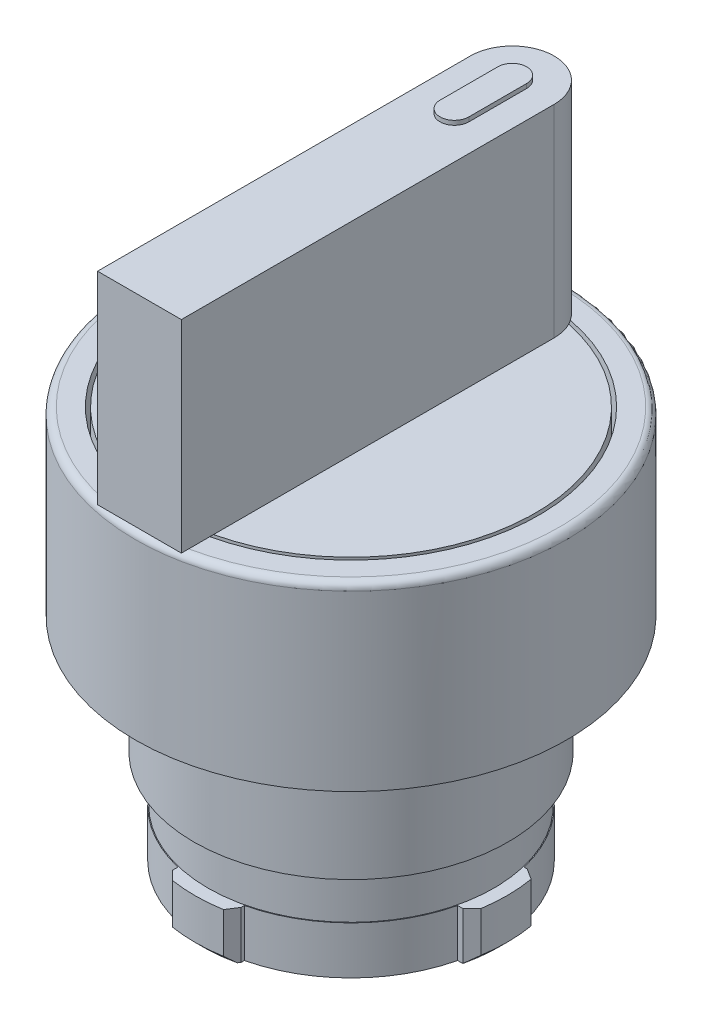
ISO-10303-21;
HEADER;
FILE_DESCRIPTION(('STEP AP214'),'2;1');
FILE_NAME('part.step','',(''),(''),'','','');
FILE_SCHEMA(('AUTOMOTIVE_DESIGN { 1 0 10303 214 1 1 1 1 }'));
ENDSEC;
DATA;
#1=APPLICATION_CONTEXT('core data for automotive mechanical design processes');
#2=APPLICATION_PROTOCOL_DEFINITION('international standard','automotive_design',2000,#1);
#3=PRODUCT_CONTEXT('',#1,'mechanical');
#4=PRODUCT('Part','Part','',(#3));
#5=PRODUCT_RELATED_PRODUCT_CATEGORY('part','',(#4));
#6=PRODUCT_DEFINITION_FORMATION('','',#4);
#7=PRODUCT_DEFINITION_CONTEXT('part definition',#1,'design');
#8=PRODUCT_DEFINITION('design','',#6,#7);
#9=PRODUCT_DEFINITION_SHAPE('','',#8);
#10=(LENGTH_UNIT() NAMED_UNIT(*) SI_UNIT(.MILLI.,.METRE.));
#11=(NAMED_UNIT(*) PLANE_ANGLE_UNIT() SI_UNIT($,.RADIAN.));
#12=(NAMED_UNIT(*) SI_UNIT($,.STERADIAN.) SOLID_ANGLE_UNIT());
#13=UNCERTAINTY_MEASURE_WITH_UNIT(LENGTH_MEASURE(1.E-05),#10,'distance_accuracy_value','');
#14=(GEOMETRIC_REPRESENTATION_CONTEXT(3) GLOBAL_UNCERTAINTY_ASSIGNED_CONTEXT((#13)) GLOBAL_UNIT_ASSIGNED_CONTEXT((#10,
#11,#12)) REPRESENTATION_CONTEXT('',''));
#15=CARTESIAN_POINT('',(0.,0.,0.));
#16=DIRECTION('',(0.,0.,1.));
#17=DIRECTION('',(1.,0.,0.));
#18=AXIS2_PLACEMENT_3D('',#15,#16,#17);
#19=CARTESIAN_POINT('',(0.,7.25,0.));
#20=DIRECTION('',(0.,1.,0.));
#21=DIRECTION('',(1.,0.,0.));
#22=AXIS2_PLACEMENT_3D('',#19,#20,#21);
#23=PLANE('',#22);
#24=CARTESIAN_POINT('',(0.,7.25,0.));
#25=DIRECTION('',(0.,-1.,0.));
#26=DIRECTION('',(0.,0.,-1.));
#27=AXIS2_PLACEMENT_3D('',#24,#25,#26);
#28=CIRCLE('',#27,12.75);
#29=CARTESIAN_POINT('',(0.,7.25,12.75));
#30=VERTEX_POINT('',#29);
#31=EDGE_CURVE('E485',#30,#30,#28,.T.);
#32=ORIENTED_EDGE('',*,*,#31,.T.);
#33=EDGE_LOOP('',(#32));
#34=FACE_BOUND('',#33,.T.);
#35=CARTESIAN_POINT('',(0.,7.25,0.));
#36=DIRECTION('',(0.,1.,0.));
#37=DIRECTION('',(0.,0.,1.));
#38=AXIS2_PLACEMENT_3D('',#35,#36,#37);
#39=CIRCLE('',#38,13.);
#40=CARTESIAN_POINT('',(0.,7.25,-13.));
#41=VERTEX_POINT('',#40);
#42=EDGE_CURVE('E435',#41,#41,#39,.T.);
#43=ORIENTED_EDGE('',*,*,#42,.T.);
#44=EDGE_LOOP('',(#43));
#45=FACE_BOUND('',#44,.T.);
#46=ADVANCED_FACE('F16',(#34,#45),#23,.T.);
#47=CARTESIAN_POINT('',(-9.89788402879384,0.0966782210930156,2.29999999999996));
#48=DIRECTION('',(0.540298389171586,0.,-0.841473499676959));
#49=DIRECTION('',(0.,-1.,0.));
#50=AXIS2_PLACEMENT_3D('',#47,#48,#49);
#51=PLANE('',#50);
#52=DIRECTION('',(0.841473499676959,0.,0.540298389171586));
#53=VECTOR('',#52,1.);
#54=CARTESIAN_POINT('',(-9.89788402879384,-4.65,2.29999999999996));
#55=LINE('',#54,#53);
#56=CARTESIAN_POINT('',(-10.6455555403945,-4.65,1.81993055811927));
#57=VERTEX_POINT('',#56);
#58=CARTESIAN_POINT('',(-9.89788402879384,-4.65,2.29999999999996));
#59=VERTEX_POINT('',#58);
#60=EDGE_CURVE('E571',#57,#59,#55,.T.);
#61=ORIENTED_EDGE('',*,*,#60,.F.);
#62=DIRECTION('',(0.,1.,0.));
#63=VECTOR('',#62,1.);
#64=CARTESIAN_POINT('',(-10.6455555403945,0.0966782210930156,1.81993055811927));
#65=LINE('',#64,#63);
#66=CARTESIAN_POINT('',(-10.6455555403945,-7.45,1.81993055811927));
#67=VERTEX_POINT('',#66);
#68=EDGE_CURVE('E495',#67,#57,#65,.T.);
#69=ORIENTED_EDGE('',*,*,#68,.F.);
#70=CARTESIAN_POINT('',(-10.6455555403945,-7.45,1.81993055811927));
#71=CARTESIAN_POINT('',(-10.4530165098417,-7.61895306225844,1.94355718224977));
#72=CARTESIAN_POINT('',(-10.2591407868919,-7.78578473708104,2.06804207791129));
#73=CARTESIAN_POINT('',(-10.0637208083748,-7.95,2.1935185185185));
#74=(BOUNDED_CURVE() B_SPLINE_CURVE(3,(#70,#71,#72,#73),.UNSPECIFIED.,.F.,
.F.) B_SPLINE_CURVE_WITH_KNOTS((4,4),(0.,0.000853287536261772),
.UNSPECIFIED.) CURVE() GEOMETRIC_REPRESENTATION_ITEM() RATIONAL_B_SPLINE_CURVE((1.,1.,1.,1.)) REPRESENTATION_ITEM(''));
#75=CARTESIAN_POINT('',(-10.0637208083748,-7.95,2.1935185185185));
#76=VERTEX_POINT('',#75);
#77=EDGE_CURVE('E10',#67,#76,#74,.T.);
#78=ORIENTED_EDGE('',*,*,#77,.T.);
#79=DIRECTION('',(-0.841473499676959,0.,-0.540298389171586));
#80=VECTOR('',#79,1.);
#81=CARTESIAN_POINT('',(-3.9351011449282,-7.95,6.12861966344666));
#82=LINE('',#81,#80);
#83=CARTESIAN_POINT('',(-9.89788402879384,-7.95,2.29999999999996));
#84=VERTEX_POINT('',#83);
#85=EDGE_CURVE('E500',#84,#76,#82,.T.);
#86=ORIENTED_EDGE('',*,*,#85,.F.);
#87=DIRECTION('',(0.,-1.,0.));
#88=VECTOR('',#87,1.);
#89=CARTESIAN_POINT('',(-9.89788402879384,0.0966782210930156,2.29999999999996));
#90=LINE('',#89,#88);
#91=EDGE_CURVE('E609',#59,#84,#90,.T.);
#92=ORIENTED_EDGE('',*,*,#91,.F.);
#93=EDGE_LOOP('',(#61,#69,#78,#86,#92));
#94=FACE_BOUND('',#93,.T.);
#95=ADVANCED_FACE('F1011',(#94),#51,.F.);
#96=CARTESIAN_POINT('',(0.,-7.95,0.));
#97=DIRECTION('',(0.,1.,0.));
#98=DIRECTION('',(0.,0.,1.));
#99=AXIS2_PLACEMENT_3D('',#96,#97,#98);
#100=CONICAL_SURFACE('',#99,10.3,0.785398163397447);
#101=DIRECTION('',(-0.716079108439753,0.698019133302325,0.));
#102=VECTOR('',#101,1.);
#103=CARTESIAN_POINT('',(-10.0399203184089,-7.95,-2.30000000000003));
#104=LINE('',#103,#102);
#105=CARTESIAN_POINT('',(-10.0399203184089,-7.95,-2.30000000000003));
#106=VERTEX_POINT('',#105);
#107=CARTESIAN_POINT('',(-10.0522509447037,-7.93798036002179,-2.30000000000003));
#108=VERTEX_POINT('',#107);
#109=EDGE_CURVE('E400',#106,#108,#104,.T.);
#110=ORIENTED_EDGE('',*,*,#109,.F.);
#111=CARTESIAN_POINT('',(0.,-7.95,0.));
#112=DIRECTION('',(0.,-1.,0.));
#113=DIRECTION('',(0.,0.,-1.));
#114=AXIS2_PLACEMENT_3D('',#111,#112,#113);
#115=CIRCLE('',#114,10.3);
#116=EDGE_CURVE('E581',#76,#106,#115,.T.);
#117=ORIENTED_EDGE('',*,*,#116,.F.);
#118=ORIENTED_EDGE('',*,*,#77,.F.);
#119=CARTESIAN_POINT('',(0.,-7.45,0.));
#120=DIRECTION('',(0.,1.,0.));
#121=DIRECTION('',(0.,0.,-1.));
#122=AXIS2_PLACEMENT_3D('',#119,#120,#121);
#123=CIRCLE('',#122,10.8);
#124=CARTESIAN_POINT('',(-10.6678371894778,-7.45,-1.68441375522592));
#125=VERTEX_POINT('',#124);
#126=EDGE_CURVE('E612',#125,#67,#123,.T.);
#127=ORIENTED_EDGE('',*,*,#126,.F.);
#128=CARTESIAN_POINT('',(-10.6678371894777,-7.45000000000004,-1.684413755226));
#129=CARTESIAN_POINT('',(-10.3529297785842,-7.71193950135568,-1.99932116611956));
#130=CARTESIAN_POINT('',(-10.0522509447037,-7.93798036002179,-2.30000000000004));
#131=(BOUNDED_CURVE() B_SPLINE_CURVE(2,(#128,#129,#130),.UNSPECIFIED.,.F.,
.F.) B_SPLINE_CURVE_WITH_KNOTS((3,3),(0.578258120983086,0.690743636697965),
.UNSPECIFIED.) CURVE() GEOMETRIC_REPRESENTATION_ITEM() RATIONAL_B_SPLINE_CURVE((1.03423541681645,
1.03305870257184,1.03012872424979)) REPRESENTATION_ITEM(''));
#132=EDGE_CURVE('E27',#125,#108,#131,.T.);
#133=ORIENTED_EDGE('',*,*,#132,.T.);
#134=EDGE_LOOP('',(#110,#117,#118,#127,#133));
#135=FACE_BOUND('',#134,.T.);
#136=ADVANCED_FACE('F997',(#135),#100,.T.);
#137=CARTESIAN_POINT('',(-10.6678371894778,0.0966782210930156,-1.68441375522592));
#138=DIRECTION('',(0.707106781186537,0.,0.707106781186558));
#139=DIRECTION('',(0.,-1.,0.));
#140=AXIS2_PLACEMENT_3D('',#137,#138,#139);
#141=PLANE('',#140);
#142=DIRECTION('',(-0.707106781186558,0.,0.707106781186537));
#143=VECTOR('',#142,1.);
#144=CARTESIAN_POINT('',(-10.6678371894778,-4.65,-1.68441375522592));
#145=LINE('',#144,#143);
#146=CARTESIAN_POINT('',(-10.0522509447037,-4.65,-2.30000000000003));
#147=VERTEX_POINT('',#146);
#148=CARTESIAN_POINT('',(-10.6678371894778,-4.65,-1.68441375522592));
#149=VERTEX_POINT('',#148);
#150=EDGE_CURVE('E457',#147,#149,#145,.T.);
#151=ORIENTED_EDGE('',*,*,#150,.F.);
#152=DIRECTION('',(0.,1.,0.));
#153=VECTOR('',#152,1.);
#154=CARTESIAN_POINT('',(-10.0522509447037,0.0966782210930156,-2.30000000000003));
#155=LINE('',#154,#153);
#156=EDGE_CURVE('E185',#108,#147,#155,.T.);
#157=ORIENTED_EDGE('',*,*,#156,.F.);
#158=ORIENTED_EDGE('',*,*,#132,.F.);
#159=DIRECTION('',(0.,-1.,0.));
#160=VECTOR('',#159,1.);
#161=CARTESIAN_POINT('',(-10.6678371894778,0.0966782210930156,-1.68441375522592));
#162=LINE('',#161,#160);
#163=EDGE_CURVE('E490',#149,#125,#162,.T.);
#164=ORIENTED_EDGE('',*,*,#163,.F.);
#165=EDGE_LOOP('',(#151,#157,#158,#164));
#166=FACE_BOUND('',#165,.T.);
#167=ADVANCED_FACE('F1000',(#166),#141,.F.);
#168=CARTESIAN_POINT('',(1.68441375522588,0.0966782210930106,-10.6678371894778));
#169=DIRECTION('',(-0.707106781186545,0.,0.70710678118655));
#170=DIRECTION('',(0.,1.,0.));
#171=AXIS2_PLACEMENT_3D('',#168,#169,#170);
#172=PLANE('',#171);
#173=DIRECTION('',(-0.70710678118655,0.,-0.707106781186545));
#174=VECTOR('',#173,1.);
#175=CARTESIAN_POINT('',(1.68441375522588,-4.65,-10.6678371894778));
#176=LINE('',#175,#174);
#177=CARTESIAN_POINT('',(2.3,-4.65,-10.0522509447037));
#178=VERTEX_POINT('',#177);
#179=CARTESIAN_POINT('',(1.68441375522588,-4.65,-10.6678371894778));
#180=VERTEX_POINT('',#179);
#181=EDGE_CURVE('E569',#178,#180,#176,.T.);
#182=ORIENTED_EDGE('',*,*,#181,.F.);
#183=DIRECTION('',(0.,1.,0.));
#184=VECTOR('',#183,1.);
#185=CARTESIAN_POINT('',(2.3,0.0966782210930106,-10.0522509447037));
#186=LINE('',#185,#184);
#187=CARTESIAN_POINT('',(2.3,-7.93798036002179,-10.0522509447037));
#188=VERTEX_POINT('',#187);
#189=EDGE_CURVE('E878',#188,#178,#186,.T.);
#190=ORIENTED_EDGE('',*,*,#189,.F.);
#191=CARTESIAN_POINT('',(2.3,-7.93798036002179,-10.0522509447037));
#192=CARTESIAN_POINT('',(1.99932116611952,-7.71193950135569,-10.3529297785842));
#193=CARTESIAN_POINT('',(1.68441375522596,-7.45000000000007,-10.6678371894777));
#194=(BOUNDED_CURVE() B_SPLINE_CURVE(2,(#191,#192,#193),.UNSPECIFIED.,.F.,
.F.) B_SPLINE_CURVE_WITH_KNOTS((3,3),(0.314781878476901,0.427267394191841),
.UNSPECIFIED.) CURVE() GEOMETRIC_REPRESENTATION_ITEM() RATIONAL_B_SPLINE_CURVE((1.03012872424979,
1.03305870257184,1.03423541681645)) REPRESENTATION_ITEM(''));
#195=CARTESIAN_POINT('',(1.68441375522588,-7.45,-10.6678371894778));
#196=VERTEX_POINT('',#195);
#197=EDGE_CURVE('E617',#188,#196,#194,.T.);
#198=ORIENTED_EDGE('',*,*,#197,.T.);
#199=DIRECTION('',(0.,-1.,0.));
#200=VECTOR('',#199,1.);
#201=CARTESIAN_POINT('',(1.68441375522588,0.0966782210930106,-10.6678371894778));
#202=LINE('',#201,#200);
#203=EDGE_CURVE('E580',#180,#196,#202,.T.);
#204=ORIENTED_EDGE('',*,*,#203,.F.);
#205=EDGE_LOOP('',(#182,#190,#198,#204));
#206=FACE_BOUND('',#205,.T.);
#207=ADVANCED_FACE('F1212',(#206),#172,.F.);
#208=CARTESIAN_POINT('',(0.,-7.95,0.));
#209=DIRECTION('',(0.,1.,0.));
#210=DIRECTION('',(0.00529655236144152,0.,-0.999985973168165));
#211=AXIS2_PLACEMENT_3D('',#208,#209,#210);
#212=CONICAL_SURFACE('',#211,10.3,0.785398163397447);
#213=CARTESIAN_POINT('',(-2.19351851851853,-7.95,-10.0637208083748));
#214=CARTESIAN_POINT('',(-2.06804207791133,-7.78578473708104,-10.2591407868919));
#215=CARTESIAN_POINT('',(-1.94355718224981,-7.61895306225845,-10.4530165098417));
#216=CARTESIAN_POINT('',(-1.81993055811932,-7.45,-10.6455555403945));
#217=(BOUNDED_CURVE() B_SPLINE_CURVE(3,(#213,#214,#215,#216),.UNSPECIFIED.,.F.,
.F.) B_SPLINE_CURVE_WITH_KNOTS((4,4),(0.,0.000853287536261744),
.UNSPECIFIED.) CURVE() GEOMETRIC_REPRESENTATION_ITEM() RATIONAL_B_SPLINE_CURVE((1.,1.,1.,1.)) REPRESENTATION_ITEM(''));
#218=CARTESIAN_POINT('',(-2.19351851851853,-7.95,-10.0637208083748));
#219=VERTEX_POINT('',#218);
#220=CARTESIAN_POINT('',(-1.81993055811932,-7.45,-10.6455555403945));
#221=VERTEX_POINT('',#220);
#222=EDGE_CURVE('E632',#219,#221,#217,.T.);
#223=ORIENTED_EDGE('',*,*,#222,.T.);
#224=CARTESIAN_POINT('',(0.,-7.45,0.));
#225=DIRECTION('',(0.,1.,0.));
#226=DIRECTION('',(0.,0.,-1.));
#227=AXIS2_PLACEMENT_3D('',#224,#225,#226);
#228=CIRCLE('',#227,10.8);
#229=EDGE_CURVE('E608',#196,#221,#228,.T.);
#230=ORIENTED_EDGE('',*,*,#229,.F.);
#231=ORIENTED_EDGE('',*,*,#197,.F.);
#232=DIRECTION('',(0.,0.698019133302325,-0.716079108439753));
#233=VECTOR('',#232,1.);
#234=CARTESIAN_POINT('',(2.3,-7.95,-10.0399203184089));
#235=LINE('',#234,#233);
#236=CARTESIAN_POINT('',(2.3,-7.95,-10.0399203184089));
#237=VERTEX_POINT('',#236);
#238=EDGE_CURVE('E494',#237,#188,#235,.T.);
#239=ORIENTED_EDGE('',*,*,#238,.F.);
#240=CARTESIAN_POINT('',(0.,-7.95,0.));
#241=DIRECTION('',(0.,-1.,0.));
#242=DIRECTION('',(0.,0.,-1.));
#243=AXIS2_PLACEMENT_3D('',#240,#241,#242);
#244=CIRCLE('',#243,10.3);
#245=EDGE_CURVE('E511',#219,#237,#244,.T.);
#246=ORIENTED_EDGE('',*,*,#245,.F.);
#247=EDGE_LOOP('',(#223,#230,#231,#239,#246));
#248=FACE_BOUND('',#247,.T.);
#249=ADVANCED_FACE('F1300',(#248),#212,.T.);
#250=CARTESIAN_POINT('',(-2.3,0.0966782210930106,-9.89788402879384));
#251=DIRECTION('',(0.841473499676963,0.,0.54029838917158));
#252=DIRECTION('',(0.,-1.,0.));
#253=AXIS2_PLACEMENT_3D('',#250,#251,#252);
#254=PLANE('',#253);
#255=DIRECTION('',(-0.54029838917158,0.,0.841473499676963));
#256=VECTOR('',#255,1.);
#257=CARTESIAN_POINT('',(-2.3,-4.65,-9.89788402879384));
#258=LINE('',#257,#256);
#259=CARTESIAN_POINT('',(-1.81993055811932,-4.65,-10.6455555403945));
#260=VERTEX_POINT('',#259);
#261=CARTESIAN_POINT('',(-2.3,-4.65,-9.89788402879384));
#262=VERTEX_POINT('',#261);
#263=EDGE_CURVE('E759',#260,#262,#258,.T.);
#264=ORIENTED_EDGE('',*,*,#263,.F.);
#265=DIRECTION('',(0.,1.,0.));
#266=VECTOR('',#265,1.);
#267=CARTESIAN_POINT('',(-1.81993055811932,0.0966782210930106,-10.6455555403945));
#268=LINE('',#267,#266);
#269=EDGE_CURVE('E603',#221,#260,#268,.T.);
#270=ORIENTED_EDGE('',*,*,#269,.F.);
#271=ORIENTED_EDGE('',*,*,#222,.F.);
#272=DIRECTION('',(0.54029838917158,0.,-0.841473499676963));
#273=VECTOR('',#272,1.);
#274=CARTESIAN_POINT('',(-6.12861966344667,-7.95,-3.93510114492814));
#275=LINE('',#274,#273);
#276=CARTESIAN_POINT('',(-2.3,-7.95,-9.89788402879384));
#277=VERTEX_POINT('',#276);
#278=EDGE_CURVE('E507',#277,#219,#275,.T.);
#279=ORIENTED_EDGE('',*,*,#278,.F.);
#280=DIRECTION('',(0.,-1.,0.));
#281=VECTOR('',#280,1.);
#282=CARTESIAN_POINT('',(-2.3,0.0966782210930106,-9.89788402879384));
#283=LINE('',#282,#281);
#284=EDGE_CURVE('E201',#262,#277,#283,.T.);
#285=ORIENTED_EDGE('',*,*,#284,.F.);
#286=EDGE_LOOP('',(#264,#270,#271,#279,#285));
#287=FACE_BOUND('',#286,.T.);
#288=ADVANCED_FACE('F1139',(#287),#254,.F.);
#289=CARTESIAN_POINT('',(10.6678371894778,0.0966782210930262,1.68441375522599));
#290=DIRECTION('',(-0.707106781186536,0.,-0.707106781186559));
#291=DIRECTION('',(-0.707106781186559,0.,0.707106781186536));
#292=AXIS2_PLACEMENT_3D('',#289,#290,#291);
#293=PLANE('',#292);
#294=DIRECTION('',(0.707106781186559,0.,-0.707106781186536));
#295=VECTOR('',#294,1.);
#296=CARTESIAN_POINT('',(10.6678371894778,-4.65,1.68441375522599));
#297=LINE('',#296,#295);
#298=CARTESIAN_POINT('',(10.0522509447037,-4.65,2.30000000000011));
#299=VERTEX_POINT('',#298);
#300=CARTESIAN_POINT('',(10.6678371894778,-4.65,1.68441375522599));
#301=VERTEX_POINT('',#300);
#302=EDGE_CURVE('E680',#299,#301,#297,.T.);
#303=ORIENTED_EDGE('',*,*,#302,.F.);
#304=DIRECTION('',(0.,1.,0.));
#305=VECTOR('',#304,1.);
#306=CARTESIAN_POINT('',(10.0522509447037,0.0966782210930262,2.30000000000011));
#307=LINE('',#306,#305);
#308=CARTESIAN_POINT('',(10.0522509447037,-7.93798036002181,2.30000000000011));
#309=VERTEX_POINT('',#308);
#310=EDGE_CURVE('E586',#309,#299,#307,.T.);
#311=ORIENTED_EDGE('',*,*,#310,.F.);
#312=CARTESIAN_POINT('',(10.0522509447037,-7.93798036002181,2.30000000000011));
#313=CARTESIAN_POINT('',(10.3529297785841,-7.7119395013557,1.99932116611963));
#314=CARTESIAN_POINT('',(10.6678371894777,-7.45000000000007,1.68441375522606));
#315=(BOUNDED_CURVE() B_SPLINE_CURVE(2,(#312,#313,#314),.UNSPECIFIED.,.F.,
.F.) B_SPLINE_CURVE_WITH_KNOTS((3,3),(0.314781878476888,0.427267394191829),
.UNSPECIFIED.) CURVE() GEOMETRIC_REPRESENTATION_ITEM() RATIONAL_B_SPLINE_CURVE((1.0301287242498,
1.03305870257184,1.03423541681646)) REPRESENTATION_ITEM(''));
#316=CARTESIAN_POINT('',(10.6678371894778,-7.45,1.68441375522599));
#317=VERTEX_POINT('',#316);
#318=EDGE_CURVE('E637',#309,#317,#315,.T.);
#319=ORIENTED_EDGE('',*,*,#318,.T.);
#320=DIRECTION('',(0.,-1.,0.));
#321=VECTOR('',#320,1.);
#322=CARTESIAN_POINT('',(10.6678371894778,0.0966782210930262,1.68441375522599));
#323=LINE('',#322,#321);
#324=EDGE_CURVE('E734',#301,#317,#323,.T.);
#325=ORIENTED_EDGE('',*,*,#324,.F.);
#326=EDGE_LOOP('',(#303,#311,#319,#325));
#327=FACE_BOUND('',#326,.T.);
#328=ADVANCED_FACE('F910',(#327),#293,.F.);
#329=CARTESIAN_POINT('',(0.,-7.95,0.));
#330=DIRECTION('',(0.,1.,0.));
#331=DIRECTION('',(0.,0.,1.));
#332=AXIS2_PLACEMENT_3D('',#329,#330,#331);
#333=CONICAL_SURFACE('',#332,10.3,0.785398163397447);
#334=CARTESIAN_POINT('',(10.0637208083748,-7.95,-2.19351851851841));
#335=CARTESIAN_POINT('',(10.259140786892,-7.78578473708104,-2.06804207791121));
#336=CARTESIAN_POINT('',(10.4530165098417,-7.61895306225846,-1.94355718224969));
#337=CARTESIAN_POINT('',(10.6455555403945,-7.45,-1.8199305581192));
#338=(BOUNDED_CURVE() B_SPLINE_CURVE(3,(#334,#335,#336,#337),.UNSPECIFIED.,.F.,
.F.) B_SPLINE_CURVE_WITH_KNOTS((4,4),(0.,0.000853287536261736),
.UNSPECIFIED.) CURVE() GEOMETRIC_REPRESENTATION_ITEM() RATIONAL_B_SPLINE_CURVE((1.,1.,1.,1.)) REPRESENTATION_ITEM(''));
#339=CARTESIAN_POINT('',(10.0637208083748,-7.95,-2.19351851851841));
#340=VERTEX_POINT('',#339);
#341=CARTESIAN_POINT('',(10.6455555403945,-7.45,-1.8199305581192));
#342=VERTEX_POINT('',#341);
#343=EDGE_CURVE('E41',#340,#342,#338,.T.);
#344=ORIENTED_EDGE('',*,*,#343,.T.);
#345=CARTESIAN_POINT('',(0.,-7.45,0.));
#346=DIRECTION('',(0.,1.,0.));
#347=DIRECTION('',(0.,0.,-1.));
#348=AXIS2_PLACEMENT_3D('',#345,#346,#347);
#349=CIRCLE('',#348,10.8);
#350=EDGE_CURVE('E766',#317,#342,#349,.T.);
#351=ORIENTED_EDGE('',*,*,#350,.F.);
#352=ORIENTED_EDGE('',*,*,#318,.F.);
#353=DIRECTION('',(0.716079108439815,0.698019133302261,0.));
#354=VECTOR('',#353,1.);
#355=CARTESIAN_POINT('',(10.0399203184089,-7.95,2.3000000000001));
#356=LINE('',#355,#354);
#357=CARTESIAN_POINT('',(10.0399203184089,-7.95,2.3000000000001));
#358=VERTEX_POINT('',#357);
#359=EDGE_CURVE('E590',#358,#309,#356,.T.);
#360=ORIENTED_EDGE('',*,*,#359,.F.);
#361=CARTESIAN_POINT('',(0.,-7.95,0.));
#362=DIRECTION('',(0.,-1.,0.));
#363=DIRECTION('',(0.,0.,-1.));
#364=AXIS2_PLACEMENT_3D('',#361,#362,#363);
#365=CIRCLE('',#364,10.3);
#366=EDGE_CURVE('E699',#340,#358,#365,.T.);
#367=ORIENTED_EDGE('',*,*,#366,.F.);
#368=EDGE_LOOP('',(#344,#351,#352,#360,#367));
#369=FACE_BOUND('',#368,.T.);
#370=ADVANCED_FACE('F1138',(#369),#333,.T.);
#371=CARTESIAN_POINT('',(9.89788402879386,0.0966782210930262,-2.2999999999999));
#372=DIRECTION('',(-0.540298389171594,0.,0.841473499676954));
#373=DIRECTION('',(0.,1.,0.));
#374=AXIS2_PLACEMENT_3D('',#371,#372,#373);
#375=PLANE('',#374);
#376=DIRECTION('',(-0.841473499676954,0.,-0.540298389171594));
#377=VECTOR('',#376,1.);
#378=CARTESIAN_POINT('',(9.89788402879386,-4.65,-2.2999999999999));
#379=LINE('',#378,#377);
#380=CARTESIAN_POINT('',(10.6455555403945,-4.65,-1.8199305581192));
#381=VERTEX_POINT('',#380);
#382=CARTESIAN_POINT('',(9.89788402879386,-4.65,-2.2999999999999));
#383=VERTEX_POINT('',#382);
#384=EDGE_CURVE('E649',#381,#383,#379,.T.);
#385=ORIENTED_EDGE('',*,*,#384,.F.);
#386=DIRECTION('',(0.,1.,0.));
#387=VECTOR('',#386,1.);
#388=CARTESIAN_POINT('',(10.6455555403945,0.0966782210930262,-1.8199305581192));
#389=LINE('',#388,#387);
#390=EDGE_CURVE('E852',#342,#381,#389,.T.);
#391=ORIENTED_EDGE('',*,*,#390,.F.);
#392=ORIENTED_EDGE('',*,*,#343,.F.);
#393=DIRECTION('',(0.841473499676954,0.,0.540298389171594));
#394=VECTOR('',#393,1.);
#395=CARTESIAN_POINT('',(3.93510114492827,-7.95,-6.12861966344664));
#396=LINE('',#395,#394);
#397=CARTESIAN_POINT('',(9.89788402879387,-7.95,-2.29999999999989));
#398=VERTEX_POINT('',#397);
#399=EDGE_CURVE('E549',#398,#340,#396,.T.);
#400=ORIENTED_EDGE('',*,*,#399,.F.);
#401=DIRECTION('',(0.,-1.,0.));
#402=VECTOR('',#401,1.);
#403=CARTESIAN_POINT('',(9.89788402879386,0.0966782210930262,-2.2999999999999));
#404=LINE('',#403,#402);
#405=EDGE_CURVE('E589',#383,#398,#404,.T.);
#406=ORIENTED_EDGE('',*,*,#405,.F.);
#407=EDGE_LOOP('',(#385,#391,#392,#400,#406));
#408=FACE_BOUND('',#407,.T.);
#409=ADVANCED_FACE('F920',(#408),#375,.F.);
#410=CARTESIAN_POINT('',(-1.68441375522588,0.0966782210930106,10.6678371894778));
#411=DIRECTION('',(0.707106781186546,0.,-0.70710678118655));
#412=DIRECTION('',(0.,-1.,0.));
#413=AXIS2_PLACEMENT_3D('',#410,#411,#412);
#414=PLANE('',#413);
#415=DIRECTION('',(0.707106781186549,0.,0.707106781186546));
#416=VECTOR('',#415,1.);
#417=CARTESIAN_POINT('',(-1.68441375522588,-4.65,10.6678371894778));
#418=LINE('',#417,#416);
#419=CARTESIAN_POINT('',(-2.3,-4.65,10.0522509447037));
#420=VERTEX_POINT('',#419);
#421=CARTESIAN_POINT('',(-1.68441375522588,-4.65,10.6678371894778));
#422=VERTEX_POINT('',#421);
#423=EDGE_CURVE('E417',#420,#422,#418,.T.);
#424=ORIENTED_EDGE('',*,*,#423,.F.);
#425=DIRECTION('',(0.,1.,0.));
#426=VECTOR('',#425,1.);
#427=CARTESIAN_POINT('',(-2.3,0.0966782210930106,10.0522509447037));
#428=LINE('',#427,#426);
#429=CARTESIAN_POINT('',(-2.3,-7.93798036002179,10.0522509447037));
#430=VERTEX_POINT('',#429);
#431=EDGE_CURVE('E760',#430,#420,#428,.T.);
#432=ORIENTED_EDGE('',*,*,#431,.F.);
#433=CARTESIAN_POINT('',(-2.3,-7.93798036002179,10.0522509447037));
#434=CARTESIAN_POINT('',(-1.99932116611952,-7.71193950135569,10.3529297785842));
#435=CARTESIAN_POINT('',(-1.68441375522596,-7.45000000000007,10.6678371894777));
#436=(BOUNDED_CURVE() B_SPLINE_CURVE(2,(#433,#434,#435),.UNSPECIFIED.,.F.,
.F.) B_SPLINE_CURVE_WITH_KNOTS((3,3),(0.314781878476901,0.42726739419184),
.UNSPECIFIED.) CURVE() GEOMETRIC_REPRESENTATION_ITEM() RATIONAL_B_SPLINE_CURVE((1.03012872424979,
1.03305870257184,1.03423541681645)) REPRESENTATION_ITEM(''));
#437=CARTESIAN_POINT('',(-1.68441375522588,-7.45,10.6678371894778));
#438=VERTEX_POINT('',#437);
#439=EDGE_CURVE('E443',#430,#438,#436,.T.);
#440=ORIENTED_EDGE('',*,*,#439,.T.);
#441=DIRECTION('',(0.,-1.,0.));
#442=VECTOR('',#441,1.);
#443=CARTESIAN_POINT('',(-1.68441375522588,0.0966782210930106,10.6678371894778));
#444=LINE('',#443,#442);
#445=EDGE_CURVE('E401',#422,#438,#444,.T.);
#446=ORIENTED_EDGE('',*,*,#445,.F.);
#447=EDGE_LOOP('',(#424,#432,#440,#446));
#448=FACE_BOUND('',#447,.T.);
#449=ADVANCED_FACE('F18',(#448),#414,.F.);
#450=CARTESIAN_POINT('',(2.3,0.0966782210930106,9.89788402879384));
#451=DIRECTION('',(-0.841473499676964,0.,-0.540298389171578));
#452=DIRECTION('',(-0.540298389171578,0.,0.841473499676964));
#453=AXIS2_PLACEMENT_3D('',#450,#451,#452);
#454=PLANE('',#453);
#455=DIRECTION('',(0.540298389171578,0.,-0.841473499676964));
#456=VECTOR('',#455,1.);
#457=CARTESIAN_POINT('',(2.3,-4.65,9.89788402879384));
#458=LINE('',#457,#456);
#459=CARTESIAN_POINT('',(1.81993055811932,-4.65,10.6455555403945));
#460=VERTEX_POINT('',#459);
#461=CARTESIAN_POINT('',(2.3,-4.65,9.89788402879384));
#462=VERTEX_POINT('',#461);
#463=EDGE_CURVE('E404',#460,#462,#458,.T.);
#464=ORIENTED_EDGE('',*,*,#463,.F.);
#465=DIRECTION('',(0.,1.,0.));
#466=VECTOR('',#465,1.);
#467=CARTESIAN_POINT('',(1.81993055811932,0.0966782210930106,10.6455555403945));
#468=LINE('',#467,#466);
#469=CARTESIAN_POINT('',(1.81993055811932,-7.45,10.6455555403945));
#470=VERTEX_POINT('',#469);
#471=EDGE_CURVE('E388',#470,#460,#468,.T.);
#472=ORIENTED_EDGE('',*,*,#471,.F.);
#473=CARTESIAN_POINT('',(2.19351851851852,-7.95,10.0637208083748));
#474=CARTESIAN_POINT('',(2.06804207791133,-7.78578473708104,10.2591407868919));
#475=CARTESIAN_POINT('',(1.94355718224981,-7.61895306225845,10.4530165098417));
#476=CARTESIAN_POINT('',(1.81993055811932,-7.45,10.6455555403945));
#477=(BOUNDED_CURVE() B_SPLINE_CURVE(3,(#473,#474,#475,#476),.UNSPECIFIED.,.F.,
.F.) B_SPLINE_CURVE_WITH_KNOTS((4,4),(0.,0.000853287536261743),
.UNSPECIFIED.) CURVE() GEOMETRIC_REPRESENTATION_ITEM() RATIONAL_B_SPLINE_CURVE((1.,1.,1.,1.)) REPRESENTATION_ITEM(''));
#478=CARTESIAN_POINT('',(2.19351851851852,-7.95,10.0637208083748));
#479=VERTEX_POINT('',#478);
#480=EDGE_CURVE('E473',#479,#470,#477,.T.);
#481=ORIENTED_EDGE('',*,*,#480,.F.);
#482=DIRECTION('',(-0.540298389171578,0.,0.841473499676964));
#483=VECTOR('',#482,1.);
#484=CARTESIAN_POINT('',(6.12861966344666,-7.95,3.93510114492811));
#485=LINE('',#484,#483);
#486=CARTESIAN_POINT('',(2.3,-7.95,9.89788402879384));
#487=VERTEX_POINT('',#486);
#488=EDGE_CURVE('E618',#487,#479,#485,.T.);
#489=ORIENTED_EDGE('',*,*,#488,.F.);
#490=DIRECTION('',(0.,-1.,0.));
#491=VECTOR('',#490,1.);
#492=CARTESIAN_POINT('',(2.3,0.0966782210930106,9.89788402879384));
#493=LINE('',#492,#491);
#494=EDGE_CURVE('E408',#462,#487,#493,.T.);
#495=ORIENTED_EDGE('',*,*,#494,.F.);
#496=EDGE_LOOP('',(#464,#472,#481,#489,#495));
#497=FACE_BOUND('',#496,.T.);
#498=ADVANCED_FACE('F405',(#497),#454,.F.);
#499=CARTESIAN_POINT('',(0.,0.0966782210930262,0.));
#500=DIRECTION('',(0.,-1.,0.));
#501=DIRECTION('',(0.,0.,-1.));
#502=AXIS2_PLACEMENT_3D('',#499,#500,#501);
#503=CYLINDRICAL_SURFACE('',#502,10.8);
#504=CARTESIAN_POINT('',(0.,-4.65,0.));
#505=DIRECTION('',(0.,1.,0.));
#506=DIRECTION('',(0.,0.,-1.));
#507=AXIS2_PLACEMENT_3D('',#504,#505,#506);
#508=CIRCLE('',#507,10.8);
#509=EDGE_CURVE('E653',#301,#381,#508,.T.);
#510=ORIENTED_EDGE('',*,*,#509,.F.);
#511=ORIENTED_EDGE('',*,*,#324,.T.);
#512=ORIENTED_EDGE('',*,*,#350,.T.);
#513=ORIENTED_EDGE('',*,*,#390,.T.);
#514=EDGE_LOOP('',(#510,#511,#512,#513));
#515=FACE_BOUND('',#514,.T.);
#516=ADVANCED_FACE('F914',(#515),#503,.T.);
#517=CARTESIAN_POINT('',(9.62912249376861,0.0966782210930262,-2.2999999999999));
#518=DIRECTION('',(0.,0.,-1.));
#519=DIRECTION('',(0.,-1.,0.));
#520=AXIS2_PLACEMENT_3D('',#517,#518,#519);
#521=PLANE('',#520);
#522=DIRECTION('',(-1.,0.,0.));
#523=VECTOR('',#522,1.);
#524=CARTESIAN_POINT('',(9.62912249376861,-4.65,-2.2999999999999));
#525=LINE('',#524,#523);
#526=CARTESIAN_POINT('',(9.68052168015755,-4.65,-2.2999999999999));
#527=VERTEX_POINT('',#526);
#528=EDGE_CURVE('E570',#383,#527,#525,.T.);
#529=ORIENTED_EDGE('',*,*,#528,.F.);
#530=ORIENTED_EDGE('',*,*,#405,.T.);
#531=DIRECTION('',(1.,0.,0.));
#532=VECTOR('',#531,1.);
#533=CARTESIAN_POINT('',(9.62912249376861,-7.95,-2.2999999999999));
#534=LINE('',#533,#532);
#535=CARTESIAN_POINT('',(9.68052168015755,-7.95,-2.2999999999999));
#536=VERTEX_POINT('',#535);
#537=EDGE_CURVE('E545',#536,#398,#534,.T.);
#538=ORIENTED_EDGE('',*,*,#537,.F.);
#539=DIRECTION('',(0.,-1.,0.));
#540=VECTOR('',#539,1.);
#541=CARTESIAN_POINT('',(9.68052168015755,-7.95,-2.2999999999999));
#542=LINE('',#541,#540);
#543=EDGE_CURVE('E539',#527,#536,#542,.T.);
#544=ORIENTED_EDGE('',*,*,#543,.F.);
#545=EDGE_LOOP('',(#529,#530,#538,#544));
#546=FACE_BOUND('',#545,.T.);
#547=ADVANCED_FACE('F923',(#546),#521,.T.);
#548=CARTESIAN_POINT('',(9.62912249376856,0.0966782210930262,2.3000000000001));
#549=DIRECTION('',(0.,0.,1.));
#550=DIRECTION('',(1.,0.,0.));
#551=AXIS2_PLACEMENT_3D('',#548,#549,#550);
#552=PLANE('',#551);
#553=ORIENTED_EDGE('',*,*,#359,.T.);
#554=ORIENTED_EDGE('',*,*,#310,.T.);
#555=DIRECTION('',(1.,0.,0.));
#556=VECTOR('',#555,1.);
#557=CARTESIAN_POINT('',(9.62912249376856,-4.65,2.3000000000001));
#558=LINE('',#557,#556);
#559=CARTESIAN_POINT('',(9.68052168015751,-4.65,2.3000000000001));
#560=VERTEX_POINT('',#559);
#561=EDGE_CURVE('E717',#560,#299,#558,.T.);
#562=ORIENTED_EDGE('',*,*,#561,.F.);
#563=DIRECTION('',(0.,1.,0.));
#564=VECTOR('',#563,1.);
#565=CARTESIAN_POINT('',(9.68052168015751,-7.95,2.3000000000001));
#566=LINE('',#565,#564);
#567=CARTESIAN_POINT('',(9.68052168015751,-7.95,2.3000000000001));
#568=VERTEX_POINT('',#567);
#569=EDGE_CURVE('E591',#568,#560,#566,.T.);
#570=ORIENTED_EDGE('',*,*,#569,.F.);
#571=DIRECTION('',(-1.,0.,0.));
#572=VECTOR('',#571,1.);
#573=CARTESIAN_POINT('',(9.62912249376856,-7.95,2.3000000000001));
#574=LINE('',#573,#572);
#575=EDGE_CURVE('E714',#358,#568,#574,.T.);
#576=ORIENTED_EDGE('',*,*,#575,.F.);
#577=EDGE_LOOP('',(#553,#554,#562,#570,#576));
#578=FACE_BOUND('',#577,.T.);
#579=ADVANCED_FACE('F905',(#578),#552,.T.);
#580=CARTESIAN_POINT('',(-2.3,0.0966782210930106,-9.62912249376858));
#581=DIRECTION('',(-1.,0.,0.));
#582=DIRECTION('',(0.,1.,0.));
#583=AXIS2_PLACEMENT_3D('',#580,#581,#582);
#584=PLANE('',#583);
#585=DIRECTION('',(0.,0.,1.));
#586=VECTOR('',#585,1.);
#587=CARTESIAN_POINT('',(-2.3,-4.65,-9.62912249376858));
#588=LINE('',#587,#586);
#589=CARTESIAN_POINT('',(-2.3,-4.65,-9.68052168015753));
#590=VERTEX_POINT('',#589);
#591=EDGE_CURVE('E458',#262,#590,#588,.T.);
#592=ORIENTED_EDGE('',*,*,#591,.F.);
#593=ORIENTED_EDGE('',*,*,#284,.T.);
#594=DIRECTION('',(0.,0.,-1.));
#595=VECTOR('',#594,1.);
#596=CARTESIAN_POINT('',(-2.3,-7.95,-9.62912249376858));
#597=LINE('',#596,#595);
#598=CARTESIAN_POINT('',(-2.3,-7.95,-9.68052168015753));
#599=VERTEX_POINT('',#598);
#600=EDGE_CURVE('E512',#599,#277,#597,.T.);
#601=ORIENTED_EDGE('',*,*,#600,.F.);
#602=DIRECTION('',(0.,-1.,0.));
#603=VECTOR('',#602,1.);
#604=CARTESIAN_POINT('',(-2.3,-7.95,-9.68052168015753));
#605=LINE('',#604,#603);
#606=EDGE_CURVE('E735',#590,#599,#605,.T.);
#607=ORIENTED_EDGE('',*,*,#606,.F.);
#608=EDGE_LOOP('',(#592,#593,#601,#607));
#609=FACE_BOUND('',#608,.T.);
#610=ADVANCED_FACE('F991',(#609),#584,.T.);
#611=CARTESIAN_POINT('',(2.3,0.0966782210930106,-9.62912249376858));
#612=DIRECTION('',(1.,0.,0.));
#613=DIRECTION('',(0.,0.,1.));
#614=AXIS2_PLACEMENT_3D('',#611,#612,#613);
#615=PLANE('',#614);
#616=ORIENTED_EDGE('',*,*,#238,.T.);
#617=ORIENTED_EDGE('',*,*,#189,.T.);
#618=DIRECTION('',(0.,0.,-1.));
#619=VECTOR('',#618,1.);
#620=CARTESIAN_POINT('',(2.3,-4.65,-9.62912249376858));
#621=LINE('',#620,#619);
#622=CARTESIAN_POINT('',(2.3,-4.65,-9.68052168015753));
#623=VERTEX_POINT('',#622);
#624=EDGE_CURVE('E565',#623,#178,#621,.T.);
#625=ORIENTED_EDGE('',*,*,#624,.F.);
#626=DIRECTION('',(0.,1.,0.));
#627=VECTOR('',#626,1.);
#628=CARTESIAN_POINT('',(2.3,-7.95,-9.68052168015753));
#629=LINE('',#628,#627);
#630=CARTESIAN_POINT('',(2.3,-7.95,-9.68052168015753));
#631=VERTEX_POINT('',#630);
#632=EDGE_CURVE('E727',#631,#623,#629,.T.);
#633=ORIENTED_EDGE('',*,*,#632,.F.);
#634=DIRECTION('',(0.,0.,1.));
#635=VECTOR('',#634,1.);
#636=CARTESIAN_POINT('',(2.3,-7.95,-9.62912249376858));
#637=LINE('',#636,#635);
#638=EDGE_CURVE('E550',#237,#631,#637,.T.);
#639=ORIENTED_EDGE('',*,*,#638,.F.);
#640=EDGE_LOOP('',(#616,#617,#625,#633,#639));
#641=FACE_BOUND('',#640,.T.);
#642=ADVANCED_FACE('F1396',(#641),#615,.T.);
#643=CARTESIAN_POINT('',(0.,0.0966782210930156,0.));
#644=DIRECTION('',(0.,-1.,0.));
#645=DIRECTION('',(0.,0.,-1.));
#646=AXIS2_PLACEMENT_3D('',#643,#644,#645);
#647=CYLINDRICAL_SURFACE('',#646,10.8);
#648=ORIENTED_EDGE('',*,*,#126,.T.);
#649=ORIENTED_EDGE('',*,*,#68,.T.);
#650=CARTESIAN_POINT('',(0.,-4.65,0.));
#651=DIRECTION('',(0.,1.,0.));
#652=DIRECTION('',(0.,0.,-1.));
#653=AXIS2_PLACEMENT_3D('',#650,#651,#652);
#654=CIRCLE('',#653,10.8);
#655=EDGE_CURVE('E428',#149,#57,#654,.T.);
#656=ORIENTED_EDGE('',*,*,#655,.F.);
#657=ORIENTED_EDGE('',*,*,#163,.T.);
#658=EDGE_LOOP('',(#648,#649,#656,#657));
#659=FACE_BOUND('',#658,.T.);
#660=ADVANCED_FACE('F1008',(#659),#647,.T.);
#661=CARTESIAN_POINT('',(-9.62912249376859,0.0966782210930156,2.29999999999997));
#662=DIRECTION('',(0.,0.,1.));
#663=DIRECTION('',(1.,0.,0.));
#664=AXIS2_PLACEMENT_3D('',#661,#662,#663);
#665=PLANE('',#664);
#666=DIRECTION('',(1.,0.,0.));
#667=VECTOR('',#666,1.);
#668=CARTESIAN_POINT('',(-9.62912249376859,-4.65,2.29999999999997));
#669=LINE('',#668,#667);
#670=CARTESIAN_POINT('',(-9.68052168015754,-4.65,2.29999999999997));
#671=VERTEX_POINT('',#670);
#672=EDGE_CURVE('E575',#59,#671,#669,.T.);
#673=ORIENTED_EDGE('',*,*,#672,.F.);
#674=ORIENTED_EDGE('',*,*,#91,.T.);
#675=DIRECTION('',(-1.,0.,0.));
#676=VECTOR('',#675,1.);
#677=CARTESIAN_POINT('',(-9.62912249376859,-7.95,2.29999999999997));
#678=LINE('',#677,#676);
#679=CARTESIAN_POINT('',(-9.68052168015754,-7.95,2.29999999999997));
#680=VERTEX_POINT('',#679);
#681=EDGE_CURVE('E496',#680,#84,#678,.T.);
#682=ORIENTED_EDGE('',*,*,#681,.F.);
#683=DIRECTION('',(0.,-1.,0.));
#684=VECTOR('',#683,1.);
#685=CARTESIAN_POINT('',(-9.68052168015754,-7.95,2.29999999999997));
#686=LINE('',#685,#684);
#687=EDGE_CURVE('E533',#671,#680,#686,.T.);
#688=ORIENTED_EDGE('',*,*,#687,.F.);
#689=EDGE_LOOP('',(#673,#674,#682,#688));
#690=FACE_BOUND('',#689,.T.);
#691=ADVANCED_FACE('F1017',(#690),#665,.T.);
#692=CARTESIAN_POINT('',(-9.62912249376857,0.0966782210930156,-2.30000000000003));
#693=DIRECTION('',(0.,0.,-1.));
#694=DIRECTION('',(0.,-1.,0.));
#695=AXIS2_PLACEMENT_3D('',#692,#693,#694);
#696=PLANE('',#695);
#697=ORIENTED_EDGE('',*,*,#109,.T.);
#698=ORIENTED_EDGE('',*,*,#156,.T.);
#699=DIRECTION('',(-1.,0.,0.));
#700=VECTOR('',#699,1.);
#701=CARTESIAN_POINT('',(-9.62912249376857,-4.65,-2.30000000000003));
#702=LINE('',#701,#700);
#703=CARTESIAN_POINT('',(-9.68052168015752,-4.65,-2.30000000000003));
#704=VERTEX_POINT('',#703);
#705=EDGE_CURVE('E450',#704,#147,#702,.T.);
#706=ORIENTED_EDGE('',*,*,#705,.F.);
#707=DIRECTION('',(0.,1.,0.));
#708=VECTOR('',#707,1.);
#709=CARTESIAN_POINT('',(-9.68052168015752,-7.95,-2.30000000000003));
#710=LINE('',#709,#708);
#711=CARTESIAN_POINT('',(-9.68052168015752,-7.95,-2.30000000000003));
#712=VERTEX_POINT('',#711);
#713=EDGE_CURVE('E770',#712,#704,#710,.T.);
#714=ORIENTED_EDGE('',*,*,#713,.F.);
#715=DIRECTION('',(1.,0.,0.));
#716=VECTOR('',#715,1.);
#717=CARTESIAN_POINT('',(-9.62912249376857,-7.95,-2.30000000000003));
#718=LINE('',#717,#716);
#719=EDGE_CURVE('E585',#106,#712,#718,.T.);
#720=ORIENTED_EDGE('',*,*,#719,.F.);
#721=EDGE_LOOP('',(#697,#698,#706,#714,#720));
#722=FACE_BOUND('',#721,.T.);
#723=ADVANCED_FACE('F995',(#722),#696,.T.);
#724=CARTESIAN_POINT('',(0.,0.0966782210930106,0.));
#725=DIRECTION('',(0.,-1.,0.));
#726=DIRECTION('',(0.00635816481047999,0.,0.999979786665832));
#727=AXIS2_PLACEMENT_3D('',#724,#725,#726);
#728=CYLINDRICAL_SURFACE('',#727,10.8);
#729=CARTESIAN_POINT('',(0.,-4.65,0.));
#730=DIRECTION('',(0.,1.,0.));
#731=DIRECTION('',(0.,0.,-1.));
#732=AXIS2_PLACEMENT_3D('',#729,#730,#731);
#733=CIRCLE('',#732,10.8);
#734=EDGE_CURVE('E392',#422,#460,#733,.T.);
#735=ORIENTED_EDGE('',*,*,#734,.F.);
#736=ORIENTED_EDGE('',*,*,#445,.T.);
#737=CARTESIAN_POINT('',(0.,-7.45,0.));
#738=DIRECTION('',(0.,1.,0.));
#739=DIRECTION('',(0.,0.,-1.));
#740=AXIS2_PLACEMENT_3D('',#737,#738,#739);
#741=CIRCLE('',#740,10.8);
#742=EDGE_CURVE('E395',#438,#470,#741,.T.);
#743=ORIENTED_EDGE('',*,*,#742,.T.);
#744=ORIENTED_EDGE('',*,*,#471,.T.);
#745=EDGE_LOOP('',(#735,#736,#743,#744));
#746=FACE_BOUND('',#745,.T.);
#747=ADVANCED_FACE('F390',(#746),#728,.T.);
#748=CARTESIAN_POINT('',(2.3,0.0966782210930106,9.62912249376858));
#749=DIRECTION('',(1.,0.,0.));
#750=DIRECTION('',(0.,0.,-1.));
#751=AXIS2_PLACEMENT_3D('',#748,#749,#750);
#752=PLANE('',#751);
#753=DIRECTION('',(0.,0.,-1.));
#754=VECTOR('',#753,1.);
#755=CARTESIAN_POINT('',(2.3,-4.65,9.62912249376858));
#756=LINE('',#755,#754);
#757=CARTESIAN_POINT('',(2.3,-4.65,9.68052168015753));
#758=VERTEX_POINT('',#757);
#759=EDGE_CURVE('E412',#462,#758,#756,.T.);
#760=ORIENTED_EDGE('',*,*,#759,.F.);
#761=ORIENTED_EDGE('',*,*,#494,.T.);
#762=DIRECTION('',(0.,0.,1.));
#763=VECTOR('',#762,1.);
#764=CARTESIAN_POINT('',(2.3,-7.95,9.62912249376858));
#765=LINE('',#764,#763);
#766=CARTESIAN_POINT('',(2.3,-7.95,9.68052168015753));
#767=VERTEX_POINT('',#766);
#768=EDGE_CURVE('E625',#767,#487,#765,.T.);
#769=ORIENTED_EDGE('',*,*,#768,.F.);
#770=DIRECTION('',(0.,-1.,0.));
#771=VECTOR('',#770,1.);
#772=CARTESIAN_POINT('',(2.3,-7.95,9.68052168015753));
#773=LINE('',#772,#771);
#774=EDGE_CURVE('E756',#758,#767,#773,.T.);
#775=ORIENTED_EDGE('',*,*,#774,.F.);
#776=EDGE_LOOP('',(#760,#761,#769,#775));
#777=FACE_BOUND('',#776,.T.);
#778=ADVANCED_FACE('F1266',(#777),#752,.T.);
#779=CARTESIAN_POINT('',(-2.3,0.0966782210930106,9.62912249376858));
#780=DIRECTION('',(-1.,0.,0.));
#781=DIRECTION('',(0.,0.,1.));
#782=AXIS2_PLACEMENT_3D('',#779,#780,#781);
#783=PLANE('',#782);
#784=DIRECTION('',(0.,0.698019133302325,0.716079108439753));
#785=VECTOR('',#784,1.);
#786=CARTESIAN_POINT('',(-2.3,-7.95,10.0399203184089));
#787=LINE('',#786,#785);
#788=CARTESIAN_POINT('',(-2.3,-7.95,10.0399203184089));
#789=VERTEX_POINT('',#788);
#790=EDGE_CURVE('E449',#789,#430,#787,.T.);
#791=ORIENTED_EDGE('',*,*,#790,.T.);
#792=ORIENTED_EDGE('',*,*,#431,.T.);
#793=DIRECTION('',(0.,0.,1.));
#794=VECTOR('',#793,1.);
#795=CARTESIAN_POINT('',(-2.3,-4.65,9.62912249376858));
#796=LINE('',#795,#794);
#797=CARTESIAN_POINT('',(-2.3,-4.65,9.68052168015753));
#798=VERTEX_POINT('',#797);
#799=EDGE_CURVE('E424',#798,#420,#796,.T.);
#800=ORIENTED_EDGE('',*,*,#799,.F.);
#801=DIRECTION('',(0.,1.,0.));
#802=VECTOR('',#801,1.);
#803=CARTESIAN_POINT('',(-2.3,-7.95,9.68052168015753));
#804=LINE('',#803,#802);
#805=CARTESIAN_POINT('',(-2.3,-7.95,9.68052168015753));
#806=VERTEX_POINT('',#805);
#807=EDGE_CURVE('E501',#806,#798,#804,.T.);
#808=ORIENTED_EDGE('',*,*,#807,.F.);
#809=DIRECTION('',(0.,0.,-1.));
#810=VECTOR('',#809,1.);
#811=CARTESIAN_POINT('',(-2.3,-7.95,9.62912249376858));
#812=LINE('',#811,#810);
#813=EDGE_CURVE('E557',#789,#806,#812,.T.);
#814=ORIENTED_EDGE('',*,*,#813,.F.);
#815=EDGE_LOOP('',(#791,#792,#800,#808,#814));
#816=FACE_BOUND('',#815,.T.);
#817=ADVANCED_FACE('F1024',(#816),#783,.T.);
#818=CARTESIAN_POINT('',(0.,19.25,0.));
#819=DIRECTION('',(0.,-1.,0.));
#820=DIRECTION('',(0.,0.,-1.));
#821=AXIS2_PLACEMENT_3D('',#818,#819,#820);
#822=PLANE('',#821);
#823=CARTESIAN_POINT('',(0.,19.25,-11.1594527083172));
#824=DIRECTION('',(0.,-1.,0.));
#825=DIRECTION('',(0.,0.,-1.));
#826=AXIS2_PLACEMENT_3D('',#823,#824,#825);
#827=CIRCLE('',#826,2.9);
#828=CARTESIAN_POINT('',(-2.40833935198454,19.25,-12.7749716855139));
#829=VERTEX_POINT('',#828);
#830=CARTESIAN_POINT('',(2.40833935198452,19.25,-12.7749716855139));
#831=VERTEX_POINT('',#830);
#832=EDGE_CURVE('E629',#829,#831,#827,.T.);
#833=ORIENTED_EDGE('',*,*,#832,.T.);
#834=CARTESIAN_POINT('',(0.,19.25,0.));
#835=DIRECTION('',(0.,1.,0.));
#836=DIRECTION('',(0.,0.,1.));
#837=AXIS2_PLACEMENT_3D('',#834,#835,#836);
#838=CIRCLE('',#837,13.);
#839=CARTESIAN_POINT('',(2.9,19.25,12.6724109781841));
#840=VERTEX_POINT('',#839);
#841=EDGE_CURVE('E439',#840,#831,#838,.T.);
#842=ORIENTED_EDGE('',*,*,#841,.F.);
#843=DIRECTION('',(0.,0.,1.));
#844=VECTOR('',#843,1.);
#845=CARTESIAN_POINT('',(2.9,19.25,0.));
#846=LINE('',#845,#844);
#847=CARTESIAN_POINT('',(2.9,19.25,14.1304856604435));
#848=VERTEX_POINT('',#847);
#849=EDGE_CURVE('E442',#840,#848,#846,.T.);
#850=ORIENTED_EDGE('',*,*,#849,.T.);
#851=CARTESIAN_POINT('',(0.,19.25,0.));
#852=DIRECTION('',(0.,1.,0.));
#853=DIRECTION('',(0.,0.,-1.));
#854=AXIS2_PLACEMENT_3D('',#851,#852,#853);
#855=CIRCLE('',#854,14.425);
#856=CARTESIAN_POINT('',(-2.9,19.25,14.1304856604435));
#857=VERTEX_POINT('',#856);
#858=EDGE_CURVE('E844',#848,#857,#855,.T.);
#859=ORIENTED_EDGE('',*,*,#858,.T.);
#860=DIRECTION('',(0.,0.,-1.));
#861=VECTOR('',#860,1.);
#862=CARTESIAN_POINT('',(-2.9,19.25,0.));
#863=LINE('',#862,#861);
#864=CARTESIAN_POINT('',(-2.9,19.25,12.6724109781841));
#865=VERTEX_POINT('',#864);
#866=EDGE_CURVE('E648',#857,#865,#863,.T.);
#867=ORIENTED_EDGE('',*,*,#866,.T.);
#868=CARTESIAN_POINT('',(0.,19.25,0.));
#869=DIRECTION('',(0.,1.,0.));
#870=DIRECTION('',(0.,0.,1.));
#871=AXIS2_PLACEMENT_3D('',#868,#869,#870);
#872=CIRCLE('',#871,13.);
#873=EDGE_CURVE('E654',#829,#865,#872,.T.);
#874=ORIENTED_EDGE('',*,*,#873,.F.);
#875=EDGE_LOOP('',(#833,#842,#850,#859,#867,#874));
#876=FACE_BOUND('',#875,.T.);
#877=ADVANCED_FACE('F799',(#876),#822,.F.);
#878=CARTESIAN_POINT('',(0.,6.74,0.));
#879=DIRECTION('',(0.,1.,0.));
#880=DIRECTION('',(1.,0.,0.));
#881=AXIS2_PLACEMENT_3D('',#878,#879,#880);
#882=PLANE('',#881);
#883=CARTESIAN_POINT('',(0.,6.74,0.));
#884=DIRECTION('',(0.,1.,0.));
#885=DIRECTION('',(0.,0.,1.));
#886=AXIS2_PLACEMENT_3D('',#883,#884,#885);
#887=CIRCLE('',#886,12.);
#888=CARTESIAN_POINT('',(0.,6.74,12.));
#889=VERTEX_POINT('',#888);
#890=EDGE_CURVE('E673',#889,#889,#887,.T.);
#891=ORIENTED_EDGE('',*,*,#890,.T.);
#892=EDGE_LOOP('',(#891));
#893=FACE_BOUND('',#892,.T.);
#894=CARTESIAN_POINT('',(0.,6.74,0.));
#895=DIRECTION('',(0.,1.,0.));
#896=DIRECTION('',(0.,0.,1.));
#897=AXIS2_PLACEMENT_3D('',#894,#895,#896);
#898=CIRCLE('',#897,14.925);
#899=CARTESIAN_POINT('',(0.,6.74,14.925));
#900=VERTEX_POINT('',#899);
#901=EDGE_CURVE('E607',#900,#900,#898,.T.);
#902=ORIENTED_EDGE('',*,*,#901,.F.);
#903=EDGE_LOOP('',(#902));
#904=FACE_BOUND('',#903,.T.);
#905=ADVANCED_FACE('F1092',(#893,#904),#882,.F.);
#906=CARTESIAN_POINT('',(0.,5.4,0.));
#907=DIRECTION('',(0.,1.,0.));
#908=DIRECTION('',(1.,0.,0.));
#909=AXIS2_PLACEMENT_3D('',#906,#907,#908);
#910=PLANE('',#909);
#911=CARTESIAN_POINT('',(0.,5.4,0.));
#912=DIRECTION('',(0.,1.,0.));
#913=DIRECTION('',(0.,0.,1.));
#914=AXIS2_PLACEMENT_3D('',#911,#912,#913);
#915=CIRCLE('',#914,10.875);
#916=CARTESIAN_POINT('',(0.,5.4,10.875));
#917=VERTEX_POINT('',#916);
#918=EDGE_CURVE('E827',#917,#917,#915,.T.);
#919=ORIENTED_EDGE('',*,*,#918,.T.);
#920=EDGE_LOOP('',(#919));
#921=FACE_BOUND('',#920,.T.);
#922=CARTESIAN_POINT('',(0.,5.4,0.));
#923=DIRECTION('',(0.,1.,0.));
#924=DIRECTION('',(0.,0.,1.));
#925=AXIS2_PLACEMENT_3D('',#922,#923,#924);
#926=CIRCLE('',#925,12.);
#927=CARTESIAN_POINT('',(0.,5.4,12.));
#928=VERTEX_POINT('',#927);
#929=EDGE_CURVE('E848',#928,#928,#926,.T.);
#930=ORIENTED_EDGE('',*,*,#929,.F.);
#931=EDGE_LOOP('',(#930));
#932=FACE_BOUND('',#931,.T.);
#933=ADVANCED_FACE('F1163',(#921,#932),#910,.F.);
#934=CARTESIAN_POINT('',(0.,-1.4,0.));
#935=DIRECTION('',(0.,1.,0.));
#936=DIRECTION('',(1.,0.,0.));
#937=AXIS2_PLACEMENT_3D('',#934,#935,#936);
#938=PLANE('',#937);
#939=CARTESIAN_POINT('',(0.,-1.4,0.));
#940=DIRECTION('',(0.,1.,0.));
#941=DIRECTION('',(0.,0.,1.));
#942=AXIS2_PLACEMENT_3D('',#939,#940,#941);
#943=CIRCLE('',#942,9.9);
#944=CARTESIAN_POINT('',(0.,-1.4,9.9));
#945=VERTEX_POINT('',#944);
#946=EDGE_CURVE('E826',#945,#945,#943,.T.);
#947=ORIENTED_EDGE('',*,*,#946,.T.);
#948=EDGE_LOOP('',(#947));
#949=FACE_BOUND('',#948,.T.);
#950=CARTESIAN_POINT('',(0.,-1.4,0.));
#951=DIRECTION('',(0.,1.,0.));
#952=DIRECTION('',(0.,0.,1.));
#953=AXIS2_PLACEMENT_3D('',#950,#951,#952);
#954=CIRCLE('',#953,10.875);
#955=CARTESIAN_POINT('',(0.,-1.4,10.875));
#956=VERTEX_POINT('',#955);
#957=EDGE_CURVE('E823',#956,#956,#954,.T.);
#958=ORIENTED_EDGE('',*,*,#957,.F.);
#959=EDGE_LOOP('',(#958));
#960=FACE_BOUND('',#959,.T.);
#961=ADVANCED_FACE('F1233',(#949,#960),#938,.F.);
#962=CARTESIAN_POINT('',(0.,-4.65,0.));
#963=DIRECTION('',(0.,-1.,0.));
#964=DIRECTION('',(0.,0.,-1.));
#965=AXIS2_PLACEMENT_3D('',#962,#963,#964);
#966=PLANE('',#965);
#967=CARTESIAN_POINT('',(0.,-4.65,0.));
#968=DIRECTION('',(0.,-1.,0.));
#969=DIRECTION('',(0.,0.,-1.));
#970=AXIS2_PLACEMENT_3D('',#967,#968,#969);
#971=CIRCLE('',#970,9.9);
#972=CARTESIAN_POINT('',(0.,-4.65,9.9));
#973=VERTEX_POINT('',#972);
#974=EDGE_CURVE('E822',#973,#973,#971,.T.);
#975=ORIENTED_EDGE('',*,*,#974,.T.);
#976=EDGE_LOOP('',(#975));
#977=FACE_BOUND('',#976,.T.);
#978=ORIENTED_EDGE('',*,*,#799,.T.);
#979=ORIENTED_EDGE('',*,*,#423,.T.);
#980=ORIENTED_EDGE('',*,*,#734,.T.);
#981=ORIENTED_EDGE('',*,*,#463,.T.);
#982=ORIENTED_EDGE('',*,*,#759,.T.);
#983=CARTESIAN_POINT('',(0.,-4.65,0.));
#984=DIRECTION('',(0.,-1.,0.));
#985=DIRECTION('',(0.,0.,-1.));
#986=AXIS2_PLACEMENT_3D('',#983,#984,#985);
#987=CIRCLE('',#986,9.95);
#988=EDGE_CURVE('E595',#560,#758,#987,.T.);
#989=ORIENTED_EDGE('',*,*,#988,.F.);
#990=ORIENTED_EDGE('',*,*,#561,.T.);
#991=ORIENTED_EDGE('',*,*,#302,.T.);
#992=ORIENTED_EDGE('',*,*,#509,.T.);
#993=ORIENTED_EDGE('',*,*,#384,.T.);
#994=ORIENTED_EDGE('',*,*,#528,.T.);
#995=CARTESIAN_POINT('',(0.,-4.65,0.));
#996=DIRECTION('',(0.,-1.,0.));
#997=DIRECTION('',(0.,0.,-1.));
#998=AXIS2_PLACEMENT_3D('',#995,#996,#997);
#999=CIRCLE('',#998,9.95);
#1000=EDGE_CURVE('E544',#623,#527,#999,.T.);
#1001=ORIENTED_EDGE('',*,*,#1000,.F.);
#1002=ORIENTED_EDGE('',*,*,#624,.T.);
#1003=ORIENTED_EDGE('',*,*,#181,.T.);
#1004=CARTESIAN_POINT('',(0.,-4.65,0.));
#1005=DIRECTION('',(0.,1.,0.));
#1006=DIRECTION('',(0.,0.,-1.));
#1007=AXIS2_PLACEMENT_3D('',#1004,#1005,#1006);
#1008=CIRCLE('',#1007,10.8);
#1009=EDGE_CURVE('E576',#180,#260,#1008,.T.);
#1010=ORIENTED_EDGE('',*,*,#1009,.T.);
#1011=ORIENTED_EDGE('',*,*,#263,.T.);
#1012=ORIENTED_EDGE('',*,*,#591,.T.);
#1013=CARTESIAN_POINT('',(0.,-4.65,0.));
#1014=DIRECTION('',(0.,-1.,0.));
#1015=DIRECTION('',(0.,0.,-1.));
#1016=AXIS2_PLACEMENT_3D('',#1013,#1014,#1015);
#1017=CIRCLE('',#1016,9.95);
#1018=EDGE_CURVE('E740',#704,#590,#1017,.T.);
#1019=ORIENTED_EDGE('',*,*,#1018,.F.);
#1020=ORIENTED_EDGE('',*,*,#705,.T.);
#1021=ORIENTED_EDGE('',*,*,#150,.T.);
#1022=ORIENTED_EDGE('',*,*,#655,.T.);
#1023=ORIENTED_EDGE('',*,*,#60,.T.);
#1024=ORIENTED_EDGE('',*,*,#672,.T.);
#1025=CARTESIAN_POINT('',(0.,-4.65,0.));
#1026=DIRECTION('',(0.,-1.,0.));
#1027=DIRECTION('',(0.,0.,-1.));
#1028=AXIS2_PLACEMENT_3D('',#1025,#1026,#1027);
#1029=CIRCLE('',#1028,9.95);
#1030=EDGE_CURVE('E538',#798,#671,#1029,.T.);
#1031=ORIENTED_EDGE('',*,*,#1030,.F.);
#1032=EDGE_LOOP('',(#978,#979,#980,#981,#982,#989,#990,#991,#992,#993,#994,#1001,#1002,#1003,
#1010,#1011,#1012,#1019,#1020,#1021,#1022,#1023,#1024,#1031));
#1033=FACE_BOUND('',#1032,.T.);
#1034=ADVANCED_FACE('F415',(#977,#1033),#966,.F.);
#1035=CARTESIAN_POINT('',(0.,-7.95,0.));
#1036=DIRECTION('',(0.,-1.,0.));
#1037=DIRECTION('',(0.,0.,-1.));
#1038=AXIS2_PLACEMENT_3D('',#1035,#1036,#1037);
#1039=PLANE('',#1038);
#1040=ORIENTED_EDGE('',*,*,#681,.T.);
#1041=ORIENTED_EDGE('',*,*,#85,.T.);
#1042=ORIENTED_EDGE('',*,*,#116,.T.);
#1043=ORIENTED_EDGE('',*,*,#719,.T.);
#1044=CARTESIAN_POINT('',(0.,-7.95,0.));
#1045=DIRECTION('',(0.,-1.,0.));
#1046=DIRECTION('',(0.,0.,-1.));
#1047=AXIS2_PLACEMENT_3D('',#1044,#1045,#1046);
#1048=CIRCLE('',#1047,9.95);
#1049=EDGE_CURVE('E739',#712,#599,#1048,.T.);
#1050=ORIENTED_EDGE('',*,*,#1049,.T.);
#1051=ORIENTED_EDGE('',*,*,#600,.T.);
#1052=ORIENTED_EDGE('',*,*,#278,.T.);
#1053=ORIENTED_EDGE('',*,*,#245,.T.);
#1054=ORIENTED_EDGE('',*,*,#638,.T.);
#1055=CARTESIAN_POINT('',(0.,-7.95,0.));
#1056=DIRECTION('',(0.,-1.,0.));
#1057=DIRECTION('',(0.,0.,-1.));
#1058=AXIS2_PLACEMENT_3D('',#1055,#1056,#1057);
#1059=CIRCLE('',#1058,9.95);
#1060=EDGE_CURVE('E543',#631,#536,#1059,.T.);
#1061=ORIENTED_EDGE('',*,*,#1060,.T.);
#1062=ORIENTED_EDGE('',*,*,#537,.T.);
#1063=ORIENTED_EDGE('',*,*,#399,.T.);
#1064=ORIENTED_EDGE('',*,*,#366,.T.);
#1065=ORIENTED_EDGE('',*,*,#575,.T.);
#1066=CARTESIAN_POINT('',(0.,-7.95,0.));
#1067=DIRECTION('',(0.,-1.,0.));
#1068=DIRECTION('',(0.,0.,-1.));
#1069=AXIS2_PLACEMENT_3D('',#1066,#1067,#1068);
#1070=CIRCLE('',#1069,9.95);
#1071=EDGE_CURVE('E596',#568,#767,#1070,.T.);
#1072=ORIENTED_EDGE('',*,*,#1071,.T.);
#1073=ORIENTED_EDGE('',*,*,#768,.T.);
#1074=ORIENTED_EDGE('',*,*,#488,.T.);
#1075=CARTESIAN_POINT('',(0.,-7.95,0.));
#1076=DIRECTION('',(0.,-1.,0.));
#1077=DIRECTION('',(0.,0.,-1.));
#1078=AXIS2_PLACEMENT_3D('',#1075,#1076,#1077);
#1079=CIRCLE('',#1078,10.3);
#1080=EDGE_CURVE('E438',#479,#789,#1079,.T.);
#1081=ORIENTED_EDGE('',*,*,#1080,.T.);
#1082=ORIENTED_EDGE('',*,*,#813,.T.);
#1083=CARTESIAN_POINT('',(0.,-7.95,0.));
#1084=DIRECTION('',(0.,-1.,0.));
#1085=DIRECTION('',(0.,0.,-1.));
#1086=AXIS2_PLACEMENT_3D('',#1083,#1084,#1085);
#1087=CIRCLE('',#1086,9.95);
#1088=EDGE_CURVE('E537',#806,#680,#1087,.T.);
#1089=ORIENTED_EDGE('',*,*,#1088,.T.);
#1090=EDGE_LOOP('',(#1040,#1041,#1042,#1043,#1050,#1051,#1052,#1053,#1054,#1061,#1062,#1063,
#1064,#1065,#1072,#1073,#1074,#1081,#1082,#1089));
#1091=FACE_BOUND('',#1090,.T.);
#1092=ADVANCED_FACE('F993',(#1091),#1039,.T.);
#1093=CARTESIAN_POINT('',(0.,-7.95,0.));
#1094=DIRECTION('',(0.,1.,0.));
#1095=DIRECTION('',(0.,0.,1.));
#1096=AXIS2_PLACEMENT_3D('',#1093,#1094,#1095);
#1097=CYLINDRICAL_SURFACE('',#1096,9.95);
#1098=ORIENTED_EDGE('',*,*,#1030,.T.);
#1099=ORIENTED_EDGE('',*,*,#687,.T.);
#1100=ORIENTED_EDGE('',*,*,#1088,.F.);
#1101=ORIENTED_EDGE('',*,*,#807,.T.);
#1102=EDGE_LOOP('',(#1098,#1099,#1100,#1101));
#1103=FACE_BOUND('',#1102,.T.);
#1104=ADVANCED_FACE('F1020',(#1103),#1097,.T.);
#1105=CARTESIAN_POINT('',(0.,-7.95,0.));
#1106=DIRECTION('',(0.,1.,0.));
#1107=DIRECTION('',(0.,0.,1.));
#1108=AXIS2_PLACEMENT_3D('',#1105,#1106,#1107);
#1109=CYLINDRICAL_SURFACE('',#1108,9.95);
#1110=ORIENTED_EDGE('',*,*,#1018,.T.);
#1111=ORIENTED_EDGE('',*,*,#606,.T.);
#1112=ORIENTED_EDGE('',*,*,#1049,.F.);
#1113=ORIENTED_EDGE('',*,*,#713,.T.);
#1114=EDGE_LOOP('',(#1110,#1111,#1112,#1113));
#1115=FACE_BOUND('',#1114,.T.);
#1116=ADVANCED_FACE('F987',(#1115),#1109,.T.);
#1117=CARTESIAN_POINT('',(0.,-7.95,0.));
#1118=DIRECTION('',(0.,1.,0.));
#1119=DIRECTION('',(0.,0.,1.));
#1120=AXIS2_PLACEMENT_3D('',#1117,#1118,#1119);
#1121=CYLINDRICAL_SURFACE('',#1120,9.95);
#1122=ORIENTED_EDGE('',*,*,#1000,.T.);
#1123=ORIENTED_EDGE('',*,*,#543,.T.);
#1124=ORIENTED_EDGE('',*,*,#1060,.F.);
#1125=ORIENTED_EDGE('',*,*,#632,.T.);
#1126=EDGE_LOOP('',(#1122,#1123,#1124,#1125));
#1127=FACE_BOUND('',#1126,.T.);
#1128=ADVANCED_FACE('F928',(#1127),#1121,.T.);
#1129=CARTESIAN_POINT('',(0.,-7.95,0.));
#1130=DIRECTION('',(0.,1.,0.));
#1131=DIRECTION('',(0.,0.,1.));
#1132=AXIS2_PLACEMENT_3D('',#1129,#1130,#1131);
#1133=CYLINDRICAL_SURFACE('',#1132,9.95);
#1134=ORIENTED_EDGE('',*,*,#1071,.F.);
#1135=ORIENTED_EDGE('',*,*,#569,.T.);
#1136=ORIENTED_EDGE('',*,*,#988,.T.);
#1137=ORIENTED_EDGE('',*,*,#774,.T.);
#1138=EDGE_LOOP('',(#1134,#1135,#1136,#1137));
#1139=FACE_BOUND('',#1138,.T.);
#1140=ADVANCED_FACE('F1152',(#1139),#1133,.T.);
#1141=CARTESIAN_POINT('',(0.,-1.4,0.));
#1142=DIRECTION('',(0.,-1.,0.));
#1143=DIRECTION('',(0.,0.,-1.));
#1144=AXIS2_PLACEMENT_3D('',#1141,#1142,#1143);
#1145=CYLINDRICAL_SURFACE('',#1144,9.9);
#1146=ORIENTED_EDGE('',*,*,#974,.F.);
#1147=EDGE_LOOP('',(#1146));
#1148=FACE_BOUND('',#1147,.T.);
#1149=ORIENTED_EDGE('',*,*,#946,.F.);
#1150=EDGE_LOOP('',(#1149));
#1151=FACE_BOUND('',#1150,.T.);
#1152=ADVANCED_FACE('F1146',(#1148,#1151),#1145,.T.);
#1153=CARTESIAN_POINT('',(0.,5.4,0.));
#1154=DIRECTION('',(0.,-1.,0.));
#1155=DIRECTION('',(0.,0.,-1.));
#1156=AXIS2_PLACEMENT_3D('',#1153,#1154,#1155);
#1157=CYLINDRICAL_SURFACE('',#1156,10.875);
#1158=ORIENTED_EDGE('',*,*,#957,.T.);
#1159=EDGE_LOOP('',(#1158));
#1160=FACE_BOUND('',#1159,.T.);
#1161=ORIENTED_EDGE('',*,*,#918,.F.);
#1162=EDGE_LOOP('',(#1161));
#1163=FACE_BOUND('',#1162,.T.);
#1164=ADVANCED_FACE('F1151',(#1160,#1163),#1157,.T.);
#1165=CARTESIAN_POINT('',(0.,6.74,0.));
#1166=DIRECTION('',(0.,-1.,0.));
#1167=DIRECTION('',(0.,0.,-1.));
#1168=AXIS2_PLACEMENT_3D('',#1165,#1166,#1167);
#1169=CYLINDRICAL_SURFACE('',#1168,12.);
#1170=ORIENTED_EDGE('',*,*,#929,.T.);
#1171=EDGE_LOOP('',(#1170));
#1172=FACE_BOUND('',#1171,.T.);
#1173=ORIENTED_EDGE('',*,*,#890,.F.);
#1174=EDGE_LOOP('',(#1173));
#1175=FACE_BOUND('',#1174,.T.);
#1176=ADVANCED_FACE('F1255',(#1172,#1175),#1169,.T.);
#1177=CARTESIAN_POINT('',(0.,88.6642748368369,0.));
#1178=DIRECTION('',(0.,-1.,0.));
#1179=DIRECTION('',(0.,0.,-1.));
#1180=AXIS2_PLACEMENT_3D('',#1177,#1178,#1179);
#1181=CYLINDRICAL_SURFACE('',#1180,14.925);
#1182=ORIENTED_EDGE('',*,*,#901,.T.);
#1183=EDGE_LOOP('',(#1182));
#1184=FACE_BOUND('',#1183,.T.);
#1185=CARTESIAN_POINT('',(0.,18.75,0.));
#1186=DIRECTION('',(0.,-1.,0.));
#1187=DIRECTION('',(0.,0.,-1.));
#1188=AXIS2_PLACEMENT_3D('',#1185,#1186,#1187);
#1189=CIRCLE('',#1188,14.925);
#1190=CARTESIAN_POINT('',(0.,18.75,14.925));
#1191=VERTEX_POINT('',#1190);
#1192=EDGE_CURVE('E657',#1191,#1191,#1189,.T.);
#1193=ORIENTED_EDGE('',*,*,#1192,.T.);
#1194=EDGE_LOOP('',(#1193));
#1195=FACE_BOUND('',#1194,.T.);
#1196=ADVANCED_FACE('F1249',(#1184,#1195),#1181,.T.);
#1197=CARTESIAN_POINT('',(0.,0.0966782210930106,0.));
#1198=DIRECTION('',(0.,-1.,0.));
#1199=DIRECTION('',(0.,0.,-1.));
#1200=AXIS2_PLACEMENT_3D('',#1197,#1198,#1199);
#1201=CYLINDRICAL_SURFACE('',#1200,10.8);
#1202=ORIENTED_EDGE('',*,*,#1009,.F.);
#1203=ORIENTED_EDGE('',*,*,#203,.T.);
#1204=ORIENTED_EDGE('',*,*,#229,.T.);
#1205=ORIENTED_EDGE('',*,*,#269,.T.);
#1206=EDGE_LOOP('',(#1202,#1203,#1204,#1205));
#1207=FACE_BOUND('',#1206,.T.);
#1208=ADVANCED_FACE('F1254',(#1207),#1201,.T.);
#1209=CARTESIAN_POINT('',(0.,-7.95,0.));
#1210=DIRECTION('',(0.,1.,0.));
#1211=DIRECTION('',(0.,0.,1.));
#1212=AXIS2_PLACEMENT_3D('',#1209,#1210,#1211);
#1213=CONICAL_SURFACE('',#1212,10.3,0.785398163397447);
#1214=ORIENTED_EDGE('',*,*,#1080,.F.);
#1215=ORIENTED_EDGE('',*,*,#480,.T.);
#1216=ORIENTED_EDGE('',*,*,#742,.F.);
#1217=ORIENTED_EDGE('',*,*,#439,.F.);
#1218=ORIENTED_EDGE('',*,*,#790,.F.);
#1219=EDGE_LOOP('',(#1214,#1215,#1216,#1217,#1218));
#1220=FACE_BOUND('',#1219,.T.);
#1221=ADVANCED_FACE('F1030',(#1220),#1213,.T.);
#1222=CARTESIAN_POINT('',(0.,7.25,0.));
#1223=DIRECTION('',(0.,1.,0.));
#1224=DIRECTION('',(0.,0.,1.));
#1225=AXIS2_PLACEMENT_3D('',#1222,#1223,#1224);
#1226=CYLINDRICAL_SURFACE('',#1225,13.);
#1227=ORIENTED_EDGE('',*,*,#42,.F.);
#1228=EDGE_LOOP('',(#1227));
#1229=FACE_BOUND('',#1228,.T.);
#1230=CARTESIAN_POINT('',(0.,19.25,0.));
#1231=DIRECTION('',(0.,1.,0.));
#1232=DIRECTION('',(0.,0.,1.));
#1233=AXIS2_PLACEMENT_3D('',#1230,#1231,#1232);
#1234=CIRCLE('',#1233,13.);
#1235=EDGE_CURVE('E513',#831,#829,#1234,.T.);
#1236=ORIENTED_EDGE('',*,*,#1235,.T.);
#1237=ORIENTED_EDGE('',*,*,#873,.T.);
#1238=CARTESIAN_POINT('',(0.,19.25,0.));
#1239=DIRECTION('',(0.,1.,0.));
#1240=DIRECTION('',(0.,0.,1.));
#1241=AXIS2_PLACEMENT_3D('',#1238,#1239,#1240);
#1242=CIRCLE('',#1241,13.);
#1243=EDGE_CURVE('E470',#865,#840,#1242,.T.);
#1244=ORIENTED_EDGE('',*,*,#1243,.T.);
#1245=ORIENTED_EDGE('',*,*,#841,.T.);
#1246=EDGE_LOOP('',(#1236,#1237,#1244,#1245));
#1247=FACE_BOUND('',#1246,.T.);
#1248=ADVANCED_FACE('F789',(#1229,#1247),#1226,.F.);
#1249=CARTESIAN_POINT('',(0.,18.75,0.));
#1250=DIRECTION('',(0.,-1.,0.));
#1251=DIRECTION('',(0.,0.,-1.));
#1252=AXIS2_PLACEMENT_3D('',#1249,#1250,#1251);
#1253=TOROIDAL_SURFACE('',#1252,14.425,0.5);
#1254=ORIENTED_EDGE('',*,*,#1192,.F.);
#1255=EDGE_LOOP('',(#1254));
#1256=FACE_BOUND('',#1255,.T.);
#1257=CARTESIAN_POINT('',(0.,19.25,0.));
#1258=DIRECTION('',(0.,1.,0.));
#1259=DIRECTION('',(0.,0.,-1.));
#1260=AXIS2_PLACEMENT_3D('',#1257,#1258,#1259);
#1261=CIRCLE('',#1260,14.425);
#1262=EDGE_CURVE('E505',#857,#848,#1261,.T.);
#1263=ORIENTED_EDGE('',*,*,#1262,.F.);
#1264=ORIENTED_EDGE('',*,*,#858,.F.);
#1265=EDGE_LOOP('',(#1263,#1264));
#1266=FACE_BOUND('',#1265,.T.);
#1267=ADVANCED_FACE('F1174',(#1256,#1266),#1253,.T.);
#1268=CARTESIAN_POINT('',(0.,33.55,-11.1594527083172));
#1269=DIRECTION('',(0.,1.,0.));
#1270=DIRECTION('',(1.,0.,0.));
#1271=AXIS2_PLACEMENT_3D('',#1268,#1269,#1270);
#1272=PLANE('',#1271);
#1273=CARTESIAN_POINT('',(0.,33.55,-11.1594527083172));
#1274=DIRECTION('',(0.,1.,0.));
#1275=DIRECTION('',(0.,0.,1.));
#1276=AXIS2_PLACEMENT_3D('',#1273,#1274,#1275);
#1277=CIRCLE('',#1276,1.);
#1278=CARTESIAN_POINT('',(1.,33.55,-11.1594527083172));
#1279=VERTEX_POINT('',#1278);
#1280=CARTESIAN_POINT('',(-1.,33.55,-11.1594527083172));
#1281=VERTEX_POINT('',#1280);
#1282=EDGE_CURVE('E744',#1279,#1281,#1277,.T.);
#1283=ORIENTED_EDGE('',*,*,#1282,.T.);
#1284=DIRECTION('',(0.,0.,1.));
#1285=VECTOR('',#1284,1.);
#1286=CARTESIAN_POINT('',(-1.,33.55,-11.1594527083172));
#1287=LINE('',#1286,#1285);
#1288=CARTESIAN_POINT('',(-1.,33.55,-7.15945270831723));
#1289=VERTEX_POINT('',#1288);
#1290=EDGE_CURVE('E602',#1281,#1289,#1287,.T.);
#1291=ORIENTED_EDGE('',*,*,#1290,.T.);
#1292=CARTESIAN_POINT('',(0.,33.55,-7.15945270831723));
#1293=DIRECTION('',(0.,1.,0.));
#1294=DIRECTION('',(0.,0.,1.));
#1295=AXIS2_PLACEMENT_3D('',#1292,#1293,#1294);
#1296=CIRCLE('',#1295,1.);
#1297=CARTESIAN_POINT('',(1.,33.55,-7.15945270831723));
#1298=VERTEX_POINT('',#1297);
#1299=EDGE_CURVE('E845',#1289,#1298,#1296,.T.);
#1300=ORIENTED_EDGE('',*,*,#1299,.T.);
#1301=DIRECTION('',(0.,0.,-1.));
#1302=VECTOR('',#1301,1.);
#1303=CARTESIAN_POINT('',(1.,33.55,-11.1594527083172));
#1304=LINE('',#1303,#1302);
#1305=EDGE_CURVE('E837',#1298,#1279,#1304,.T.);
#1306=ORIENTED_EDGE('',*,*,#1305,.T.);
#1307=EDGE_LOOP('',(#1283,#1291,#1300,#1306));
#1308=FACE_BOUND('',#1307,.T.);
#1309=ADVANCED_FACE('F1044',(#1308),#1272,.T.);
#1310=CARTESIAN_POINT('',(1.,33.55,-11.1594527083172));
#1311=DIRECTION('',(-1.,0.,0.));
#1312=DIRECTION('',(0.,1.,0.));
#1313=AXIS2_PLACEMENT_3D('',#1310,#1311,#1312);
#1314=PLANE('',#1313);
#1315=DIRECTION('',(0.,0.,-1.));
#1316=VECTOR('',#1315,1.);
#1317=CARTESIAN_POINT('',(1.,33.25,-11.1594527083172));
#1318=LINE('',#1317,#1316);
#1319=CARTESIAN_POINT('',(1.,33.25,-7.15945270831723));
#1320=VERTEX_POINT('',#1319);
#1321=CARTESIAN_POINT('',(1.,33.25,-11.1594527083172));
#1322=VERTEX_POINT('',#1321);
#1323=EDGE_CURVE('E478',#1320,#1322,#1318,.T.);
#1324=ORIENTED_EDGE('',*,*,#1323,.T.);
#1325=DIRECTION('',(0.,-1.,0.));
#1326=VECTOR('',#1325,1.);
#1327=CARTESIAN_POINT('',(1.,33.55,-11.1594527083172));
#1328=LINE('',#1327,#1326);
#1329=EDGE_CURVE('E464',#1279,#1322,#1328,.T.);
#1330=ORIENTED_EDGE('',*,*,#1329,.F.);
#1331=ORIENTED_EDGE('',*,*,#1305,.F.);
#1332=DIRECTION('',(0.,-1.,0.));
#1333=VECTOR('',#1332,1.);
#1334=CARTESIAN_POINT('',(1.,33.55,-7.15945270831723));
#1335=LINE('',#1334,#1333);
#1336=EDGE_CURVE('E812',#1298,#1320,#1335,.T.);
#1337=ORIENTED_EDGE('',*,*,#1336,.T.);
#1338=EDGE_LOOP('',(#1324,#1330,#1331,#1337));
#1339=FACE_BOUND('',#1338,.T.);
#1340=ADVANCED_FACE('F1048',(#1339),#1314,.F.);
#1341=CARTESIAN_POINT('',(0.,33.55,-7.15945270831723));
#1342=DIRECTION('',(0.,-1.,0.));
#1343=DIRECTION('',(0.,0.,1.));
#1344=AXIS2_PLACEMENT_3D('',#1341,#1342,#1343);
#1345=CYLINDRICAL_SURFACE('',#1344,1.);
#1346=CARTESIAN_POINT('',(0.,33.25,-7.15945270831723));
#1347=DIRECTION('',(0.,1.,0.));
#1348=DIRECTION('',(0.,0.,1.));
#1349=AXIS2_PLACEMENT_3D('',#1346,#1347,#1348);
#1350=CIRCLE('',#1349,1.);
#1351=CARTESIAN_POINT('',(-1.,33.25,-7.15945270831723));
#1352=VERTEX_POINT('',#1351);
#1353=EDGE_CURVE('E489',#1352,#1320,#1350,.T.);
#1354=ORIENTED_EDGE('',*,*,#1353,.T.);
#1355=ORIENTED_EDGE('',*,*,#1336,.F.);
#1356=ORIENTED_EDGE('',*,*,#1299,.F.);
#1357=DIRECTION('',(0.,-1.,0.));
#1358=VECTOR('',#1357,1.);
#1359=CARTESIAN_POINT('',(-1.,33.55,-7.15945270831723));
#1360=LINE('',#1359,#1358);
#1361=EDGE_CURVE('E517',#1289,#1352,#1360,.T.);
#1362=ORIENTED_EDGE('',*,*,#1361,.T.);
#1363=EDGE_LOOP('',(#1354,#1355,#1356,#1362));
#1364=FACE_BOUND('',#1363,.T.);
#1365=ADVANCED_FACE('F1059',(#1364),#1345,.T.);
#1366=CARTESIAN_POINT('',(-1.,33.55,-11.1594527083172));
#1367=DIRECTION('',(1.,0.,0.));
#1368=DIRECTION('',(0.,0.,-1.));
#1369=AXIS2_PLACEMENT_3D('',#1366,#1367,#1368);
#1370=PLANE('',#1369);
#1371=DIRECTION('',(0.,0.,1.));
#1372=VECTOR('',#1371,1.);
#1373=CARTESIAN_POINT('',(-1.,33.25,-11.1594527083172));
#1374=LINE('',#1373,#1372);
#1375=CARTESIAN_POINT('',(-1.,33.25,-11.1594527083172));
#1376=VERTEX_POINT('',#1375);
#1377=EDGE_CURVE('E474',#1376,#1352,#1374,.T.);
#1378=ORIENTED_EDGE('',*,*,#1377,.T.);
#1379=ORIENTED_EDGE('',*,*,#1361,.F.);
#1380=ORIENTED_EDGE('',*,*,#1290,.F.);
#1381=DIRECTION('',(0.,-1.,0.));
#1382=VECTOR('',#1381,1.);
#1383=CARTESIAN_POINT('',(-1.,33.55,-11.1594527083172));
#1384=LINE('',#1383,#1382);
#1385=EDGE_CURVE('E463',#1281,#1376,#1384,.T.);
#1386=ORIENTED_EDGE('',*,*,#1385,.T.);
#1387=EDGE_LOOP('',(#1378,#1379,#1380,#1386));
#1388=FACE_BOUND('',#1387,.T.);
#1389=ADVANCED_FACE('F1055',(#1388),#1370,.F.);
#1390=CARTESIAN_POINT('',(0.,19.25,0.));
#1391=DIRECTION('',(0.,1.,0.));
#1392=DIRECTION('',(1.,0.,0.));
#1393=AXIS2_PLACEMENT_3D('',#1390,#1391,#1392);
#1394=PLANE('',#1393);
#1395=ORIENTED_EDGE('',*,*,#1235,.F.);
#1396=CARTESIAN_POINT('',(0.,19.25,-11.1594527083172));
#1397=DIRECTION('',(0.,-1.,0.));
#1398=DIRECTION('',(0.,0.,1.));
#1399=AXIS2_PLACEMENT_3D('',#1396,#1397,#1398);
#1400=CIRCLE('',#1399,2.9);
#1401=CARTESIAN_POINT('',(2.57853480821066,19.25,-12.4865390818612));
#1402=VERTEX_POINT('',#1401);
#1403=EDGE_CURVE('E644',#831,#1402,#1400,.T.);
#1404=ORIENTED_EDGE('',*,*,#1403,.T.);
#1405=CARTESIAN_POINT('',(0.,19.25,0.));
#1406=DIRECTION('',(0.,-1.,0.));
#1407=DIRECTION('',(0.,0.,-1.));
#1408=AXIS2_PLACEMENT_3D('',#1405,#1406,#1407);
#1409=CIRCLE('',#1408,12.75);
#1410=CARTESIAN_POINT('',(-2.57853480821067,19.25,-12.4865390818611));
#1411=VERTEX_POINT('',#1410);
#1412=EDGE_CURVE('E529',#1411,#1402,#1409,.T.);
#1413=ORIENTED_EDGE('',*,*,#1412,.F.);
#1414=CARTESIAN_POINT('',(0.,19.25,-11.1594527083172));
#1415=DIRECTION('',(0.,-1.,0.));
#1416=DIRECTION('',(0.,0.,1.));
#1417=AXIS2_PLACEMENT_3D('',#1414,#1415,#1416);
#1418=CIRCLE('',#1417,2.9);
#1419=EDGE_CURVE('E524',#1411,#829,#1418,.T.);
#1420=ORIENTED_EDGE('',*,*,#1419,.T.);
#1421=EDGE_LOOP('',(#1395,#1404,#1413,#1420));
#1422=FACE_BOUND('',#1421,.T.);
#1423=ADVANCED_FACE('F794',(#1422),#1394,.F.);
#1424=CARTESIAN_POINT('',(0.,33.25,14.6405472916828));
#1425=DIRECTION('',(0.,0.,-1.));
#1426=DIRECTION('',(0.,-1.,0.));
#1427=AXIS2_PLACEMENT_3D('',#1424,#1425,#1426);
#1428=PLANE('',#1427);
#1429=DIRECTION('',(1.,0.,0.));
#1430=VECTOR('',#1429,1.);
#1431=CARTESIAN_POINT('',(0.,19.25,14.6405472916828));
#1432=LINE('',#1431,#1430);
#1433=CARTESIAN_POINT('',(-2.9,19.25,14.6405472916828));
#1434=VERTEX_POINT('',#1433);
#1435=CARTESIAN_POINT('',(2.9,19.25,14.6405472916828));
#1436=VERTEX_POINT('',#1435);
#1437=EDGE_CURVE('E434',#1434,#1436,#1432,.T.);
#1438=ORIENTED_EDGE('',*,*,#1437,.T.);
#1439=DIRECTION('',(0.,-1.,0.));
#1440=VECTOR('',#1439,1.);
#1441=CARTESIAN_POINT('',(2.9,33.25,14.6405472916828));
#1442=LINE('',#1441,#1440);
#1443=CARTESIAN_POINT('',(2.9,33.25,14.6405472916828));
#1444=VERTEX_POINT('',#1443);
#1445=EDGE_CURVE('E433',#1444,#1436,#1442,.T.);
#1446=ORIENTED_EDGE('',*,*,#1445,.F.);
#1447=DIRECTION('',(1.,0.,0.));
#1448=VECTOR('',#1447,1.);
#1449=CARTESIAN_POINT('',(0.,33.25,14.6405472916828));
#1450=LINE('',#1449,#1448);
#1451=CARTESIAN_POINT('',(-2.9,33.25,14.6405472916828));
#1452=VERTEX_POINT('',#1451);
#1453=EDGE_CURVE('E479',#1452,#1444,#1450,.T.);
#1454=ORIENTED_EDGE('',*,*,#1453,.F.);
#1455=DIRECTION('',(0.,-1.,0.));
#1456=VECTOR('',#1455,1.);
#1457=CARTESIAN_POINT('',(-2.9,33.25,14.6405472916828));
#1458=LINE('',#1457,#1456);
#1459=EDGE_CURVE('E518',#1452,#1434,#1458,.T.);
#1460=ORIENTED_EDGE('',*,*,#1459,.T.);
#1461=EDGE_LOOP('',(#1438,#1446,#1454,#1460));
#1462=FACE_BOUND('',#1461,.T.);
#1463=ADVANCED_FACE('F1098',(#1462),#1428,.F.);
#1464=CARTESIAN_POINT('',(-2.9,33.25,0.));
#1465=DIRECTION('',(1.,0.,0.));
#1466=DIRECTION('',(0.,0.,1.));
#1467=AXIS2_PLACEMENT_3D('',#1464,#1465,#1466);
#1468=PLANE('',#1467);
#1469=DIRECTION('',(0.,0.,1.));
#1470=VECTOR('',#1469,1.);
#1471=CARTESIAN_POINT('',(-2.9,19.25,0.));
#1472=LINE('',#1471,#1470);
#1473=CARTESIAN_POINT('',(-2.9,19.25,-11.1594527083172));
#1474=VERTEX_POINT('',#1473);
#1475=CARTESIAN_POINT('',(-2.9,19.25,12.4158165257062));
#1476=VERTEX_POINT('',#1475);
#1477=EDGE_CURVE('E506',#1474,#1476,#1472,.T.);
#1478=ORIENTED_EDGE('',*,*,#1477,.T.);
#1479=DIRECTION('',(0.,0.,1.));
#1480=VECTOR('',#1479,1.);
#1481=CARTESIAN_POINT('',(-2.9,19.25,0.));
#1482=LINE('',#1481,#1480);
#1483=EDGE_CURVE('E465',#1476,#865,#1482,.T.);
#1484=ORIENTED_EDGE('',*,*,#1483,.T.);
#1485=ORIENTED_EDGE('',*,*,#866,.F.);
#1486=DIRECTION('',(0.,0.,1.));
#1487=VECTOR('',#1486,1.);
#1488=CARTESIAN_POINT('',(-2.9,19.25,0.));
#1489=LINE('',#1488,#1487);
#1490=EDGE_CURVE('E430',#857,#1434,#1489,.T.);
#1491=ORIENTED_EDGE('',*,*,#1490,.T.);
#1492=ORIENTED_EDGE('',*,*,#1459,.F.);
#1493=DIRECTION('',(0.,0.,1.));
#1494=VECTOR('',#1493,1.);
#1495=CARTESIAN_POINT('',(-2.9,33.25,0.));
#1496=LINE('',#1495,#1494);
#1497=CARTESIAN_POINT('',(-2.9,33.25,-11.1594527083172));
#1498=VERTEX_POINT('',#1497);
#1499=EDGE_CURVE('E484',#1498,#1452,#1496,.T.);
#1500=ORIENTED_EDGE('',*,*,#1499,.F.);
#1501=DIRECTION('',(0.,-1.,0.));
#1502=VECTOR('',#1501,1.);
#1503=CARTESIAN_POINT('',(-2.9,33.25,-11.1594527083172));
#1504=LINE('',#1503,#1502);
#1505=EDGE_CURVE('E523',#1498,#1474,#1504,.T.);
#1506=ORIENTED_EDGE('',*,*,#1505,.T.);
#1507=EDGE_LOOP('',(#1478,#1484,#1485,#1491,#1492,#1500,#1506));
#1508=FACE_BOUND('',#1507,.T.);
#1509=ADVANCED_FACE('F1103',(#1508),#1468,.F.);
#1510=CARTESIAN_POINT('',(2.9,33.25,0.));
#1511=DIRECTION('',(1.,0.,0.));
#1512=DIRECTION('',(0.,0.,-1.));
#1513=AXIS2_PLACEMENT_3D('',#1510,#1511,#1512);
#1514=PLANE('',#1513);
#1515=DIRECTION('',(0.,0.,1.));
#1516=VECTOR('',#1515,1.);
#1517=CARTESIAN_POINT('',(2.9,19.25,0.));
#1518=LINE('',#1517,#1516);
#1519=CARTESIAN_POINT('',(2.9,19.25,-11.1594527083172));
#1520=VERTEX_POINT('',#1519);
#1521=CARTESIAN_POINT('',(2.9,19.25,12.4158165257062));
#1522=VERTEX_POINT('',#1521);
#1523=EDGE_CURVE('E502',#1520,#1522,#1518,.T.);
#1524=ORIENTED_EDGE('',*,*,#1523,.F.);
#1525=DIRECTION('',(0.,-1.,0.));
#1526=VECTOR('',#1525,1.);
#1527=CARTESIAN_POINT('',(2.9,33.25,-11.1594527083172));
#1528=LINE('',#1527,#1526);
#1529=CARTESIAN_POINT('',(2.9,33.25,-11.1594527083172));
#1530=VERTEX_POINT('',#1529);
#1531=EDGE_CURVE('E745',#1530,#1520,#1528,.T.);
#1532=ORIENTED_EDGE('',*,*,#1531,.F.);
#1533=DIRECTION('',(0.,0.,1.));
#1534=VECTOR('',#1533,1.);
#1535=CARTESIAN_POINT('',(2.9,33.25,0.));
#1536=LINE('',#1535,#1534);
#1537=EDGE_CURVE('E480',#1530,#1444,#1536,.T.);
#1538=ORIENTED_EDGE('',*,*,#1537,.T.);
#1539=ORIENTED_EDGE('',*,*,#1445,.T.);
#1540=DIRECTION('',(0.,0.,1.));
#1541=VECTOR('',#1540,1.);
#1542=CARTESIAN_POINT('',(2.9,19.25,0.));
#1543=LINE('',#1542,#1541);
#1544=EDGE_CURVE('E564',#848,#1436,#1543,.T.);
#1545=ORIENTED_EDGE('',*,*,#1544,.F.);
#1546=ORIENTED_EDGE('',*,*,#849,.F.);
#1547=DIRECTION('',(0.,0.,1.));
#1548=VECTOR('',#1547,1.);
#1549=CARTESIAN_POINT('',(2.9,19.25,0.));
#1550=LINE('',#1549,#1548);
#1551=EDGE_CURVE('E20',#1522,#840,#1550,.T.);
#1552=ORIENTED_EDGE('',*,*,#1551,.F.);
#1553=EDGE_LOOP('',(#1524,#1532,#1538,#1539,#1545,#1546,#1552));
#1554=FACE_BOUND('',#1553,.T.);
#1555=ADVANCED_FACE('F1361',(#1554),#1514,.T.);
#1556=CARTESIAN_POINT('',(0.,19.25,0.));
#1557=DIRECTION('',(0.,1.,0.));
#1558=DIRECTION('',(1.,0.,0.));
#1559=AXIS2_PLACEMENT_3D('',#1556,#1557,#1558);
#1560=PLANE('',#1559);
#1561=ORIENTED_EDGE('',*,*,#1262,.T.);
#1562=ORIENTED_EDGE('',*,*,#1544,.T.);
#1563=ORIENTED_EDGE('',*,*,#1437,.F.);
#1564=ORIENTED_EDGE('',*,*,#1490,.F.);
#1565=EDGE_LOOP('',(#1561,#1562,#1563,#1564));
#1566=FACE_BOUND('',#1565,.T.);
#1567=ADVANCED_FACE('F1117',(#1566),#1560,.F.);
#1568=CARTESIAN_POINT('',(0.,19.25,0.));
#1569=DIRECTION('',(0.,-1.,0.));
#1570=DIRECTION('',(0.,0.,-1.));
#1571=AXIS2_PLACEMENT_3D('',#1568,#1569,#1570);
#1572=PLANE('',#1571);
#1573=CARTESIAN_POINT('',(0.,19.25,-11.1594527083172));
#1574=DIRECTION('',(0.,-1.,0.));
#1575=DIRECTION('',(0.,0.,1.));
#1576=AXIS2_PLACEMENT_3D('',#1573,#1574,#1575);
#1577=CIRCLE('',#1576,2.9);
#1578=EDGE_CURVE('E667',#1402,#1520,#1577,.T.);
#1579=ORIENTED_EDGE('',*,*,#1578,.T.);
#1580=ORIENTED_EDGE('',*,*,#1523,.T.);
#1581=CARTESIAN_POINT('',(0.,19.25,0.));
#1582=DIRECTION('',(0.,-1.,0.));
#1583=DIRECTION('',(0.,0.,-1.));
#1584=AXIS2_PLACEMENT_3D('',#1581,#1582,#1583);
#1585=CIRCLE('',#1584,12.75);
#1586=EDGE_CURVE('E599',#1402,#1522,#1585,.T.);
#1587=ORIENTED_EDGE('',*,*,#1586,.F.);
#1588=EDGE_LOOP('',(#1579,#1580,#1587));
#1589=FACE_BOUND('',#1588,.T.);
#1590=ADVANCED_FACE('F1111',(#1589),#1572,.F.);
#1591=CARTESIAN_POINT('',(0.,19.25,0.));
#1592=DIRECTION('',(0.,-1.,0.));
#1593=DIRECTION('',(0.,0.,-1.));
#1594=AXIS2_PLACEMENT_3D('',#1591,#1592,#1593);
#1595=PLANE('',#1594);
#1596=ORIENTED_EDGE('',*,*,#1477,.F.);
#1597=CARTESIAN_POINT('',(0.,19.25,-11.1594527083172));
#1598=DIRECTION('',(0.,-1.,0.));
#1599=DIRECTION('',(0.,0.,1.));
#1600=AXIS2_PLACEMENT_3D('',#1597,#1598,#1599);
#1601=CIRCLE('',#1600,2.9);
#1602=EDGE_CURVE('E519',#1474,#1411,#1601,.T.);
#1603=ORIENTED_EDGE('',*,*,#1602,.T.);
#1604=CARTESIAN_POINT('',(0.,19.25,0.));
#1605=DIRECTION('',(0.,-1.,0.));
#1606=DIRECTION('',(0.,0.,-1.));
#1607=AXIS2_PLACEMENT_3D('',#1604,#1605,#1606);
#1608=CIRCLE('',#1607,12.75);
#1609=EDGE_CURVE('E525',#1476,#1411,#1608,.T.);
#1610=ORIENTED_EDGE('',*,*,#1609,.F.);
#1611=EDGE_LOOP('',(#1596,#1603,#1610));
#1612=FACE_BOUND('',#1611,.T.);
#1613=ADVANCED_FACE('F1116',(#1612),#1595,.F.);
#1614=CARTESIAN_POINT('',(0.,33.25,0.));
#1615=DIRECTION('',(0.,1.,0.));
#1616=DIRECTION('',(1.,0.,0.));
#1617=AXIS2_PLACEMENT_3D('',#1614,#1615,#1616);
#1618=PLANE('',#1617);
#1619=ORIENTED_EDGE('',*,*,#1377,.F.);
#1620=CARTESIAN_POINT('',(0.,33.25,-11.1594527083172));
#1621=DIRECTION('',(0.,1.,0.));
#1622=DIRECTION('',(0.,0.,1.));
#1623=AXIS2_PLACEMENT_3D('',#1620,#1621,#1622);
#1624=CIRCLE('',#1623,1.);
#1625=EDGE_CURVE('E459',#1322,#1376,#1624,.T.);
#1626=ORIENTED_EDGE('',*,*,#1625,.F.);
#1627=ORIENTED_EDGE('',*,*,#1323,.F.);
#1628=ORIENTED_EDGE('',*,*,#1353,.F.);
#1629=EDGE_LOOP('',(#1619,#1626,#1627,#1628));
#1630=FACE_BOUND('',#1629,.T.);
#1631=ORIENTED_EDGE('',*,*,#1537,.F.);
#1632=CARTESIAN_POINT('',(0.,33.25,-11.1594527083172));
#1633=DIRECTION('',(0.,-1.,0.));
#1634=DIRECTION('',(0.,0.,1.));
#1635=AXIS2_PLACEMENT_3D('',#1632,#1633,#1634);
#1636=CIRCLE('',#1635,2.9);
#1637=EDGE_CURVE('E749',#1498,#1530,#1636,.T.);
#1638=ORIENTED_EDGE('',*,*,#1637,.F.);
#1639=ORIENTED_EDGE('',*,*,#1499,.T.);
#1640=ORIENTED_EDGE('',*,*,#1453,.T.);
#1641=EDGE_LOOP('',(#1631,#1638,#1639,#1640));
#1642=FACE_BOUND('',#1641,.T.);
#1643=ADVANCED_FACE('F1061',(#1630,#1642),#1618,.T.);
#1644=CARTESIAN_POINT('',(0.,55.3124458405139,0.));
#1645=DIRECTION('',(0.,-1.,0.));
#1646=DIRECTION('',(0.,0.,-1.));
#1647=AXIS2_PLACEMENT_3D('',#1644,#1645,#1646);
#1648=CYLINDRICAL_SURFACE('',#1647,12.75);
#1649=ORIENTED_EDGE('',*,*,#31,.F.);
#1650=EDGE_LOOP('',(#1649));
#1651=FACE_BOUND('',#1650,.T.);
#1652=CARTESIAN_POINT('',(0.,19.25,0.));
#1653=DIRECTION('',(0.,-1.,0.));
#1654=DIRECTION('',(0.,0.,-1.));
#1655=AXIS2_PLACEMENT_3D('',#1652,#1653,#1654);
#1656=CIRCLE('',#1655,12.75);
#1657=EDGE_CURVE('E469',#1522,#1476,#1656,.T.);
#1658=ORIENTED_EDGE('',*,*,#1657,.T.);
#1659=ORIENTED_EDGE('',*,*,#1609,.T.);
#1660=ORIENTED_EDGE('',*,*,#1412,.T.);
#1661=ORIENTED_EDGE('',*,*,#1586,.T.);
#1662=EDGE_LOOP('',(#1658,#1659,#1660,#1661));
#1663=FACE_BOUND('',#1662,.T.);
#1664=ADVANCED_FACE('F1383',(#1651,#1663),#1648,.T.);
#1665=CARTESIAN_POINT('',(0.,33.25,-11.1594527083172));
#1666=DIRECTION('',(0.,-1.,0.));
#1667=DIRECTION('',(0.,0.,-1.));
#1668=AXIS2_PLACEMENT_3D('',#1665,#1666,#1667);
#1669=CYLINDRICAL_SURFACE('',#1668,2.9);
#1670=ORIENTED_EDGE('',*,*,#1637,.T.);
#1671=ORIENTED_EDGE('',*,*,#1531,.T.);
#1672=ORIENTED_EDGE('',*,*,#1578,.F.);
#1673=ORIENTED_EDGE('',*,*,#1403,.F.);
#1674=ORIENTED_EDGE('',*,*,#832,.F.);
#1675=ORIENTED_EDGE('',*,*,#1419,.F.);
#1676=ORIENTED_EDGE('',*,*,#1602,.F.);
#1677=ORIENTED_EDGE('',*,*,#1505,.F.);
#1678=EDGE_LOOP('',(#1670,#1671,#1672,#1673,#1674,#1675,#1676,#1677));
#1679=FACE_BOUND('',#1678,.T.);
#1680=ADVANCED_FACE('F801',(#1679),#1669,.T.);
#1681=CARTESIAN_POINT('',(0.,33.55,-11.1594527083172));
#1682=DIRECTION('',(0.,-1.,0.));
#1683=DIRECTION('',(0.,0.,-1.));
#1684=AXIS2_PLACEMENT_3D('',#1681,#1682,#1683);
#1685=CYLINDRICAL_SURFACE('',#1684,1.);
#1686=ORIENTED_EDGE('',*,*,#1282,.F.);
#1687=ORIENTED_EDGE('',*,*,#1329,.T.);
#1688=ORIENTED_EDGE('',*,*,#1625,.T.);
#1689=ORIENTED_EDGE('',*,*,#1385,.F.);
#1690=EDGE_LOOP('',(#1686,#1687,#1688,#1689));
#1691=FACE_BOUND('',#1690,.T.);
#1692=ADVANCED_FACE('F1053',(#1691),#1685,.T.);
#1693=CARTESIAN_POINT('',(0.,19.25,0.));
#1694=DIRECTION('',(0.,1.,0.));
#1695=DIRECTION('',(1.,0.,0.));
#1696=AXIS2_PLACEMENT_3D('',#1693,#1694,#1695);
#1697=PLANE('',#1696);
#1698=ORIENTED_EDGE('',*,*,#1243,.F.);
#1699=ORIENTED_EDGE('',*,*,#1483,.F.);
#1700=ORIENTED_EDGE('',*,*,#1657,.F.);
#1701=ORIENTED_EDGE('',*,*,#1551,.T.);
#1702=EDGE_LOOP('',(#1698,#1699,#1700,#1701));
#1703=FACE_BOUND('',#1702,.T.);
#1704=ADVANCED_FACE('F1201',(#1703),#1697,.F.);
#1705=CLOSED_SHELL('',(#46,#95,#136,#167,#207,#249,#288,#328,#370,#409,#449,#498,#516,#547,#579,
#610,#642,#660,#691,#723,#747,#778,#817,#877,#905,#933,#961,#1034,#1092,#1104,#1116,#1128,#1140,
#1152,#1164,#1176,#1196,#1208,#1221,#1248,#1267,#1309,#1340,#1365,#1389,#1423,#1463,#1509,#1555,
#1567,#1590,#1613,#1643,#1664,#1680,#1692,#1704));
#1706=MANIFOLD_SOLID_BREP('B1',#1705);
#1707=ADVANCED_BREP_SHAPE_REPRESENTATION('',(#18,#1706),#14);
#1708=SHAPE_DEFINITION_REPRESENTATION(#9,#1707);
ENDSEC;
END-ISO-10303-21;
